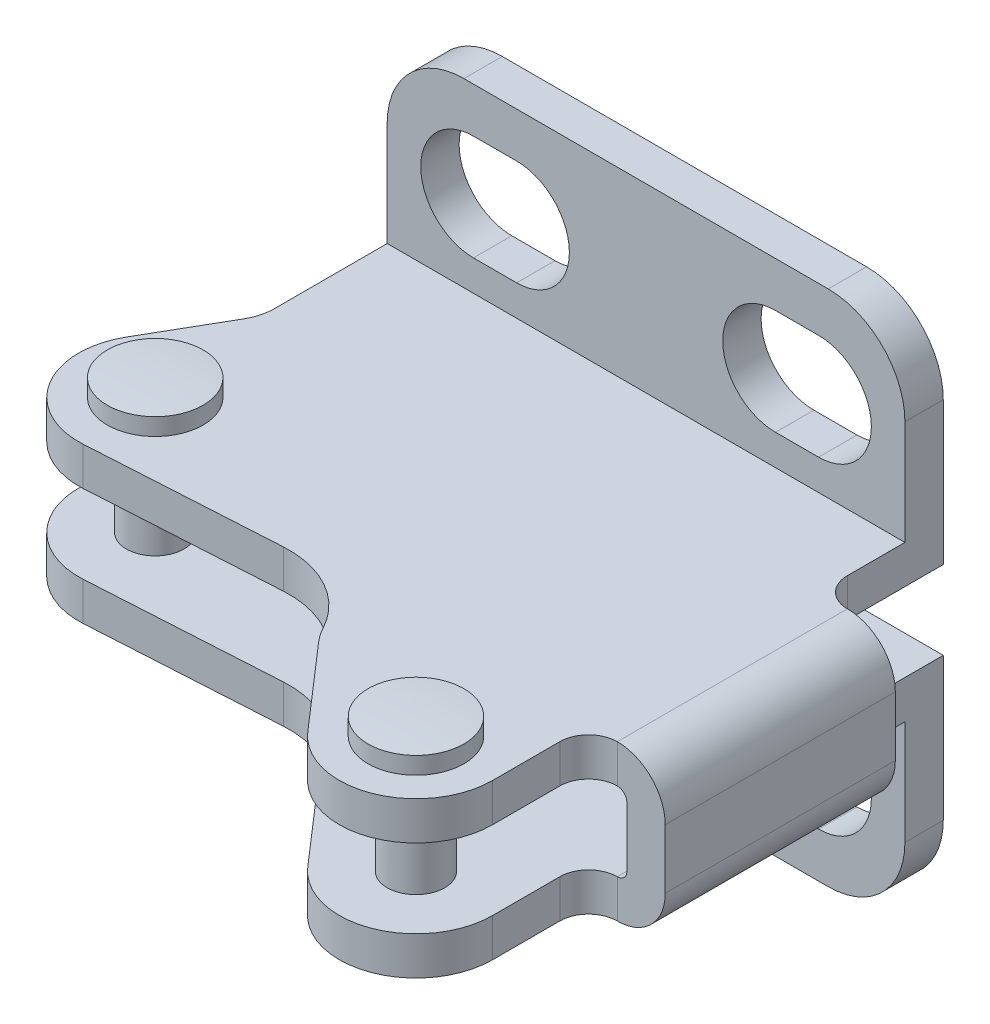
ISO-10303-21;
HEADER;
FILE_DESCRIPTION(('STEP AP214'),'2;1');
FILE_NAME('part.step','',(''),(''),'','','');
FILE_SCHEMA(('AUTOMOTIVE_DESIGN { 1 0 10303 214 1 1 1 1 }'));
ENDSEC;
DATA;
#1=APPLICATION_CONTEXT('core data for automotive mechanical design processes');
#2=APPLICATION_PROTOCOL_DEFINITION('international standard','automotive_design',2000,#1);
#3=PRODUCT_CONTEXT('',#1,'mechanical');
#4=PRODUCT('Part','Part','',(#3));
#5=PRODUCT_RELATED_PRODUCT_CATEGORY('part','',(#4));
#6=PRODUCT_DEFINITION_FORMATION('','',#4);
#7=PRODUCT_DEFINITION_CONTEXT('part definition',#1,'design');
#8=PRODUCT_DEFINITION('design','',#6,#7);
#9=PRODUCT_DEFINITION_SHAPE('','',#8);
#10=(LENGTH_UNIT() NAMED_UNIT(*) SI_UNIT(.MILLI.,.METRE.));
#11=(NAMED_UNIT(*) PLANE_ANGLE_UNIT() SI_UNIT($,.RADIAN.));
#12=(NAMED_UNIT(*) SI_UNIT($,.STERADIAN.) SOLID_ANGLE_UNIT());
#13=UNCERTAINTY_MEASURE_WITH_UNIT(LENGTH_MEASURE(1.E-05),#10,'distance_accuracy_value','');
#14=(GEOMETRIC_REPRESENTATION_CONTEXT(3) GLOBAL_UNCERTAINTY_ASSIGNED_CONTEXT((#13)) GLOBAL_UNIT_ASSIGNED_CONTEXT((#10,
#11,#12)) REPRESENTATION_CONTEXT('',''));
#15=CARTESIAN_POINT('',(0.,0.,0.));
#16=DIRECTION('',(0.,0.,1.));
#17=DIRECTION('',(1.,0.,0.));
#18=AXIS2_PLACEMENT_3D('',#15,#16,#17);
#19=CARTESIAN_POINT('',(-3.6,5.3407477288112,15.));
#20=DIRECTION('',(0.,1.,0.));
#21=DIRECTION('',(1.,0.,0.));
#22=AXIS2_PLACEMENT_3D('',#19,#20,#21);
#23=CYLINDRICAL_SURFACE('',#22,1.5);
#24=CARTESIAN_POINT('',(-3.6,6.35,15.));
#25=DIRECTION('',(0.,1.,0.));
#26=DIRECTION('',(0.,0.,-1.));
#27=AXIS2_PLACEMENT_3D('',#24,#25,#26);
#28=CIRCLE('',#27,1.5);
#29=CARTESIAN_POINT('',(-3.6,6.35,13.5));
#30=VERTEX_POINT('',#29);
#31=EDGE_CURVE('E9',#30,#30,#28,.F.);
#32=ORIENTED_EDGE('',*,*,#31,.F.);
#33=EDGE_LOOP('',(#32));
#34=FACE_BOUND('',#33,.T.);
#35=CARTESIAN_POINT('',(-3.6,10.45,15.));
#36=DIRECTION('',(0.,-1.,0.));
#37=DIRECTION('',(0.,0.,1.));
#38=AXIS2_PLACEMENT_3D('',#35,#36,#37);
#39=CIRCLE('',#38,1.5);
#40=CARTESIAN_POINT('',(-3.6,10.45,16.5));
#41=VERTEX_POINT('',#40);
#42=EDGE_CURVE('E24',#41,#41,#39,.F.);
#43=ORIENTED_EDGE('',*,*,#42,.F.);
#44=EDGE_LOOP('',(#43));
#45=FACE_BOUND('',#44,.T.);
#46=ADVANCED_FACE('F14',(#34,#45),#23,.T.);
#47=CARTESIAN_POINT('',(-3.6,4.85,15.));
#48=DIRECTION('',(0.,-1.,0.));
#49=DIRECTION('',(-1.,0.,0.));
#50=AXIS2_PLACEMENT_3D('',#47,#48,#49);
#51=CONICAL_SURFACE('',#50,0.85,1.04719755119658);
#52=CARTESIAN_POINT('',(-3.6,5.3407477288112,15.));
#53=VERTEX_POINT('',#52);
#54=VERTEX_LOOP('',#53);
#55=FACE_BOUND('',#54,.T.);
#56=CARTESIAN_POINT('',(-3.6,4.85,15.));
#57=DIRECTION('',(0.,1.,0.));
#58=DIRECTION('',(1.,0.,0.));
#59=AXIS2_PLACEMENT_3D('',#56,#57,#58);
#60=CIRCLE('',#59,0.85);
#61=CARTESIAN_POINT('',(-2.75,4.85,15.));
#62=VERTEX_POINT('',#61);
#63=EDGE_CURVE('E876',#62,#62,#60,.T.);
#64=ORIENTED_EDGE('',*,*,#63,.F.);
#65=EDGE_LOOP('',(#64));
#66=FACE_BOUND('',#65,.T.);
#67=ADVANCED_FACE('F1034',(#55,#66),#51,.F.);
#68=CARTESIAN_POINT('',(-3.6,5.3407477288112,15.));
#69=DIRECTION('',(0.,1.,0.));
#70=DIRECTION('',(1.,0.,0.));
#71=AXIS2_PLACEMENT_3D('',#68,#69,#70);
#72=CYLINDRICAL_SURFACE('',#71,0.85000000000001);
#73=ORIENTED_EDGE('',*,*,#63,.T.);
#74=EDGE_LOOP('',(#73));
#75=FACE_BOUND('',#74,.T.);
#76=CARTESIAN_POINT('',(-3.6,3.3620440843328,15.));
#77=DIRECTION('',(0.,1.,0.));
#78=DIRECTION('',(1.,0.,0.));
#79=AXIS2_PLACEMENT_3D('',#76,#77,#78);
#80=CIRCLE('',#79,0.85000000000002);
#81=CARTESIAN_POINT('',(-3.6,3.3620440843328,14.1499999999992));
#82=VERTEX_POINT('',#81);
#83=EDGE_CURVE('E880',#82,#82,#80,.T.);
#84=ORIENTED_EDGE('',*,*,#83,.F.);
#85=EDGE_LOOP('',(#84));
#86=FACE_BOUND('',#85,.T.);
#87=ADVANCED_FACE('F1042',(#75,#86),#72,.F.);
#88=CARTESIAN_POINT('',(-3.6,33.3499999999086,14.9999999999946));
#89=DIRECTION('',(0.,1.,0.));
#90=DIRECTION('',(0.,0.,-1.));
#91=AXIS2_PLACEMENT_3D('',#88,#89,#90);
#92=SPHERICAL_SURFACE('',#91,29.9999999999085);
#93=CARTESIAN_POINT('',(-3.6,3.4543481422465,15.));
#94=DIRECTION('',(0.,1.,0.));
#95=DIRECTION('',(1.,0.,0.));
#96=AXIS2_PLACEMENT_3D('',#93,#94,#95);
#97=CIRCLE('',#96,2.5);
#98=CARTESIAN_POINT('',(-3.6,3.4543481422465,12.4999999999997));
#99=VERTEX_POINT('',#98);
#100=EDGE_CURVE('E2572',#99,#99,#97,.T.);
#101=CARTESIAN_POINT('',(-3.6,3.3620440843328,14.1499999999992));
#102=CARTESIAN_POINT('',(-3.6,3.36253188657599,14.1327903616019));
#103=CARTESIAN_POINT('',(-3.6,3.36303450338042,14.1155811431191));
#104=CARTESIAN_POINT('',(-3.6,3.3640693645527,14.0811635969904));
#105=CARTESIAN_POINT('',(-3.6,3.36460160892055,14.0639552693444));
#106=CARTESIAN_POINT('',(-3.6,3.3656957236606,14.0295395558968));
#107=CARTESIAN_POINT('',(-3.6,3.3662575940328,14.0123321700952));
#108=CARTESIAN_POINT('',(-3.6,3.36741095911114,13.9779183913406));
#109=CARTESIAN_POINT('',(-3.6,3.36800245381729,13.9607119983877));
#110=CARTESIAN_POINT('',(-3.6,3.3692150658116,13.9263002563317));
#111=CARTESIAN_POINT('',(-3.6,3.36983618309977,13.9090949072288));
#112=CARTESIAN_POINT('',(-3.6,3.37110803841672,13.8746853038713));
#113=CARTESIAN_POINT('',(-3.6,3.37175877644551,13.8574810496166));
#114=CARTESIAN_POINT('',(-3.6,3.37308987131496,13.8230736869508));
#115=CARTESIAN_POINT('',(-3.6,3.37377022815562,13.8058705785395));
#116=CARTESIAN_POINT('',(-3.6,3.37516055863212,13.7714655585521));
#117=CARTESIAN_POINT('',(-3.6,3.37587053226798,13.7542636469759));
#118=CARTESIAN_POINT('',(-3.6,3.37732009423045,13.7198610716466));
#119=CARTESIAN_POINT('',(-3.6,3.37805968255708,13.7026604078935));
#120=CARTESIAN_POINT('',(-3.6,3.3795684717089,13.6682603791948));
#121=CARTESIAN_POINT('',(-3.6,3.38033767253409,13.6510610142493));
#122=CARTESIAN_POINT('',(-3.6,3.38190568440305,13.6166636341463));
#123=CARTESIAN_POINT('',(-3.6,3.38270449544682,13.5994656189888));
#124=CARTESIAN_POINT('',(-3.6,3.38433172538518,13.5650709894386));
#125=CARTESIAN_POINT('',(-3.6,3.38516014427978,13.5478743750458));
#126=CARTESIAN_POINT('',(-3.6,3.38684658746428,13.5134825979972));
#127=CARTESIAN_POINT('',(-3.6,3.38770461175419,13.4962874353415));
#128=CARTESIAN_POINT('',(-3.6,3.38945026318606,13.4618986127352));
#129=CARTESIAN_POINT('',(-3.6,3.39033789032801,13.4447049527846));
#130=CARTESIAN_POINT('',(-3.6,3.39214274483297,13.4103191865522));
#131=CARTESIAN_POINT('',(-3.6,3.39305997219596,13.3931270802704));
#132=CARTESIAN_POINT('',(-3.6,3.39492402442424,13.3587444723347));
#133=CARTESIAN_POINT('',(-3.6,3.39587084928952,13.3415539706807));
#134=CARTESIAN_POINT('',(-3.6,3.39779409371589,13.307174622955));
#135=CARTESIAN_POINT('',(-3.6,3.39877051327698,13.2899857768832));
#136=CARTESIAN_POINT('',(-3.6,3.40075294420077,13.2556097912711));
#137=CARTESIAN_POINT('',(-3.6,3.40175895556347,13.2384226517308));
#138=CARTESIAN_POINT('',(-3.6,3.40380056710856,13.204050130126));
#139=CARTESIAN_POINT('',(-3.6,3.40483616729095,13.1868647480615));
#140=CARTESIAN_POINT('',(-3.6,3.40693695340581,13.1524957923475));
#141=CARTESIAN_POINT('',(-3.6,3.40800213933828,13.135312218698));
#142=CARTESIAN_POINT('',(-3.6,3.41016209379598,13.1009469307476));
#143=CARTESIAN_POINT('',(-3.6,3.41125686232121,13.0837652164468));
#144=CARTESIAN_POINT('',(-3.6,3.41347597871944,13.049403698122));
#145=CARTESIAN_POINT('',(-3.6,3.41460032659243,13.0322238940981));
#146=CARTESIAN_POINT('',(-3.6,3.41687859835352,12.9978662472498));
#147=CARTESIAN_POINT('',(-3.6,3.41803252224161,12.9806884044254));
#148=CARTESIAN_POINT('',(-3.6,3.42036994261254,12.9463347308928));
#149=CARTESIAN_POINT('',(-3.6,3.42155343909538,12.9291589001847));
#150=CARTESIAN_POINT('',(-3.6,3.42395000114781,12.8948093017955));
#151=CARTESIAN_POINT('',(-3.6,3.42516306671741,12.8776355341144));
#152=CARTESIAN_POINT('',(-3.6,3.42761876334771,12.843290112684));
#153=CARTESIAN_POINT('',(-3.6,3.42886139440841,12.8261184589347));
#154=CARTESIAN_POINT('',(-3.6,3.43137621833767,12.7917773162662));
#155=CARTESIAN_POINT('',(-3.6,3.43264841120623,12.7746078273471));
#156=CARTESIAN_POINT('',(-3.6,3.4352223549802,12.7402710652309));
#157=CARTESIAN_POINT('',(-3.6,3.43652410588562,12.723103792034));
#158=CARTESIAN_POINT('',(-3.6,3.43915716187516,12.6887715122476));
#159=CARTESIAN_POINT('',(-3.6,3.44048846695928,12.6716065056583));
#160=CARTESIAN_POINT('',(-3.6,3.44318062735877,12.6372788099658));
#161=CARTESIAN_POINT('',(-3.6,3.44454148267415,12.6201161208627));
#162=CARTESIAN_POINT('',(-3.6,3.44729273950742,12.5857931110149));
#163=CARTESIAN_POINT('',(-3.6,3.4486831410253,12.5686327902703));
#164=CARTESIAN_POINT('',(-3.6,3.45149348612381,12.5343145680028));
#165=CARTESIAN_POINT('',(-3.6,3.45291342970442,12.51715666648));
#166=CARTESIAN_POINT('',(-3.6,3.4543481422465,12.4999999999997));
#167=B_SPLINE_CURVE_WITH_KNOTS('',3,(#101,#102,#103,#104,#105,#106,#107,#108,#109,#110,#111,
#112,#113,#114,#115,#116,#117,#118,#119,#120,#121,#122,#123,#124,#125,#126,#127,#128,#129,#130,
#131,#132,#133,#134,#135,#136,#137,#138,#139,#140,#141,#142,#143,#144,#145,#146,#147,#148,#149,
#150,#151,#152,#153,#154,#155,#156,#157,#158,#159,#160,#161,#162,#163,#164,#165,#166),
.UNSPECIFIED.,.F.,.F.,(4,2,2,2,2,2,2,2,2,2,2,2,2,2,2,2,2,2,2,2,2,2,2,2,2,2,2,2,2,2,2,2,4),(0.,
0.0516496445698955,0.103299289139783,0.154948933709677,0.206598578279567,0.258248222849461,
0.309897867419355,0.361547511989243,0.413197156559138,0.464846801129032,0.51649644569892,
0.568146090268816,0.619795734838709,0.671445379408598,0.723095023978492,0.77474466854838,
0.826394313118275,0.878043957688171,0.929693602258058,0.981343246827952,1.03299289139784,
1.08464253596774,1.13629218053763,1.18794182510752,1.23959146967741,1.29124111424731,
1.34289075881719,1.39454040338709,1.44619004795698,1.49783969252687,1.54948933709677,
1.60113898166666,1.65278862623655),.UNSPECIFIED.);
#168=EDGE_CURVE('BSEAM1038',#82,#99,#167,.T.);
#169=ORIENTED_EDGE('',*,*,#83,.T.);
#170=ORIENTED_EDGE('',*,*,#100,.F.);
#171=ORIENTED_EDGE('',*,*,#168,.T.);
#172=ORIENTED_EDGE('',*,*,#168,.F.);
#173=EDGE_LOOP('',(#169,#171,#170,#172));
#174=FACE_BOUND('',#173,.T.);
#175=ADVANCED_FACE('F1038',(#174),#92,.T.);
#176=CARTESIAN_POINT('',(-3.6,5.3407477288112,15.));
#177=DIRECTION('',(0.,1.,0.));
#178=DIRECTION('',(1.,0.,0.));
#179=AXIS2_PLACEMENT_3D('',#176,#177,#178);
#180=CYLINDRICAL_SURFACE('',#179,2.5);
#181=ORIENTED_EDGE('',*,*,#100,.T.);
#182=EDGE_LOOP('',(#181));
#183=FACE_BOUND('',#182,.T.);
#184=CARTESIAN_POINT('',(-3.6,4.35,15.));
#185=DIRECTION('',(0.,1.,0.));
#186=DIRECTION('',(1.,0.,0.));
#187=AXIS2_PLACEMENT_3D('',#184,#185,#186);
#188=CIRCLE('',#187,2.5);
#189=CARTESIAN_POINT('',(-1.1,4.35,15.));
#190=VERTEX_POINT('',#189);
#191=EDGE_CURVE('E2569',#190,#190,#188,.T.);
#192=ORIENTED_EDGE('',*,*,#191,.F.);
#193=EDGE_LOOP('',(#192));
#194=FACE_BOUND('',#193,.T.);
#195=ADVANCED_FACE('F1027',(#183,#194),#180,.T.);
#196=CARTESIAN_POINT('',(-3.6,-16.5499999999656,14.9999999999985));
#197=DIRECTION('',(0.,1.,0.));
#198=DIRECTION('',(0.,0.,1.));
#199=AXIS2_PLACEMENT_3D('',#196,#197,#198);
#200=SPHERICAL_SURFACE('',#199,29.9999999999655);
#201=CARTESIAN_POINT('',(-3.6,13.3456518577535,15.));
#202=DIRECTION('',(0.,1.,0.));
#203=DIRECTION('',(1.,0.,0.));
#204=AXIS2_PLACEMENT_3D('',#201,#202,#203);
#205=CIRCLE('',#204,2.5);
#206=CARTESIAN_POINT('',(-1.1,13.3456518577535,15.));
#207=VERTEX_POINT('',#206);
#208=EDGE_CURVE('E2547',#207,#207,#205,.T.);
#209=ORIENTED_EDGE('',*,*,#208,.T.);
#210=EDGE_LOOP('',(#209));
#211=FACE_BOUND('',#210,.T.);
#212=ADVANCED_FACE('F1024',(#211),#200,.T.);
#213=CARTESIAN_POINT('',(-3.6,5.3407477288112,15.));
#214=DIRECTION('',(0.,1.,0.));
#215=DIRECTION('',(1.,0.,0.));
#216=AXIS2_PLACEMENT_3D('',#213,#214,#215);
#217=CYLINDRICAL_SURFACE('',#216,2.5);
#218=CARTESIAN_POINT('',(-3.6,12.45,15.));
#219=DIRECTION('',(0.,1.,0.));
#220=DIRECTION('',(1.,0.,0.));
#221=AXIS2_PLACEMENT_3D('',#218,#219,#220);
#222=CIRCLE('',#221,2.5);
#223=CARTESIAN_POINT('',(-1.1,12.45,15.));
#224=VERTEX_POINT('',#223);
#225=EDGE_CURVE('E2550',#224,#224,#222,.T.);
#226=ORIENTED_EDGE('',*,*,#225,.T.);
#227=EDGE_LOOP('',(#226));
#228=FACE_BOUND('',#227,.T.);
#229=ORIENTED_EDGE('',*,*,#208,.F.);
#230=EDGE_LOOP('',(#229));
#231=FACE_BOUND('',#230,.T.);
#232=ADVANCED_FACE('F1022',(#228,#231),#217,.T.);
#233=CARTESIAN_POINT('',(18.5,4.85,23.5));
#234=DIRECTION('',(0.,-1.,0.));
#235=DIRECTION('',(-1.,0.,0.));
#236=AXIS2_PLACEMENT_3D('',#233,#234,#235);
#237=CONICAL_SURFACE('',#236,0.85,1.04719755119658);
#238=CARTESIAN_POINT('',(18.5,5.3407477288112,23.5));
#239=VERTEX_POINT('',#238);
#240=VERTEX_LOOP('',#239);
#241=FACE_BOUND('',#240,.T.);
#242=CARTESIAN_POINT('',(18.5,4.85,23.5));
#243=DIRECTION('',(0.,1.,0.));
#244=DIRECTION('',(1.,0.,0.));
#245=AXIS2_PLACEMENT_3D('',#242,#243,#244);
#246=CIRCLE('',#245,0.85);
#247=CARTESIAN_POINT('',(19.35,4.85,23.5));
#248=VERTEX_POINT('',#247);
#249=EDGE_CURVE('E873',#248,#248,#246,.T.);
#250=ORIENTED_EDGE('',*,*,#249,.F.);
#251=EDGE_LOOP('',(#250));
#252=FACE_BOUND('',#251,.T.);
#253=ADVANCED_FACE('F957',(#241,#252),#237,.F.);
#254=CARTESIAN_POINT('',(18.5,5.3407477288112,23.5));
#255=DIRECTION('',(0.,1.,0.));
#256=DIRECTION('',(1.,0.,0.));
#257=AXIS2_PLACEMENT_3D('',#254,#255,#256);
#258=CYLINDRICAL_SURFACE('',#257,0.85000000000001);
#259=ORIENTED_EDGE('',*,*,#249,.T.);
#260=EDGE_LOOP('',(#259));
#261=FACE_BOUND('',#260,.T.);
#262=CARTESIAN_POINT('',(18.5,3.3620440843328,23.5));
#263=DIRECTION('',(0.,1.,0.));
#264=DIRECTION('',(1.,0.,0.));
#265=AXIS2_PLACEMENT_3D('',#262,#263,#264);
#266=CIRCLE('',#265,0.85000000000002);
#267=CARTESIAN_POINT('',(18.5,3.3620440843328,22.6499999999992));
#268=VERTEX_POINT('',#267);
#269=EDGE_CURVE('E2556',#268,#268,#266,.T.);
#270=ORIENTED_EDGE('',*,*,#269,.F.);
#271=EDGE_LOOP('',(#270));
#272=FACE_BOUND('',#271,.T.);
#273=ADVANCED_FACE('F965',(#261,#272),#258,.F.);
#274=CARTESIAN_POINT('',(18.5,-16.5499999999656,23.4999999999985));
#275=DIRECTION('',(0.,1.,0.));
#276=DIRECTION('',(0.,0.,1.));
#277=AXIS2_PLACEMENT_3D('',#274,#275,#276);
#278=SPHERICAL_SURFACE('',#277,29.9999999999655);
#279=CARTESIAN_POINT('',(18.5,13.3456518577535,23.5));
#280=DIRECTION('',(0.,1.,0.));
#281=DIRECTION('',(1.,0.,0.));
#282=AXIS2_PLACEMENT_3D('',#279,#280,#281);
#283=CIRCLE('',#282,2.5);
#284=CARTESIAN_POINT('',(21.,13.3456518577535,23.5));
#285=VERTEX_POINT('',#284);
#286=EDGE_CURVE('E883',#285,#285,#283,.T.);
#287=ORIENTED_EDGE('',*,*,#286,.T.);
#288=EDGE_LOOP('',(#287));
#289=FACE_BOUND('',#288,.T.);
#290=ADVANCED_FACE('F949',(#289),#278,.T.);
#291=CARTESIAN_POINT('',(18.,19.55,2.));
#292=DIRECTION('',(0.,-1.,0.));
#293=DIRECTION('',(1.,0.,0.));
#294=AXIS2_PLACEMENT_3D('',#291,#292,#293);
#295=PLANE('',#294);
#296=DIRECTION('',(-1.,0.,0.));
#297=VECTOR('',#296,1.);
#298=CARTESIAN_POINT('',(18.,19.55,0.));
#299=LINE('',#298,#297);
#300=CARTESIAN_POINT('',(18.,19.55,0.));
#301=VERTEX_POINT('',#300);
#302=CARTESIAN_POINT('',(15.75,19.55,0.));
#303=VERTEX_POINT('',#302);
#304=EDGE_CURVE('E406',#301,#303,#299,.T.);
#305=ORIENTED_EDGE('',*,*,#304,.F.);
#306=DIRECTION('',(0.,0.,-1.));
#307=VECTOR('',#306,1.);
#308=CARTESIAN_POINT('',(18.,19.55,2.));
#309=LINE('',#308,#307);
#310=CARTESIAN_POINT('',(18.,19.55,2.));
#311=VERTEX_POINT('',#310);
#312=EDGE_CURVE('E424',#311,#301,#309,.T.);
#313=ORIENTED_EDGE('',*,*,#312,.F.);
#314=DIRECTION('',(-1.,0.,0.));
#315=VECTOR('',#314,1.);
#316=CARTESIAN_POINT('',(18.,19.55,2.));
#317=LINE('',#316,#315);
#318=CARTESIAN_POINT('',(15.75,19.55,2.));
#319=VERTEX_POINT('',#318);
#320=EDGE_CURVE('E420',#311,#319,#317,.T.);
#321=ORIENTED_EDGE('',*,*,#320,.T.);
#322=DIRECTION('',(0.,0.,-1.));
#323=VECTOR('',#322,1.);
#324=CARTESIAN_POINT('',(15.75,19.55,2.));
#325=LINE('',#324,#323);
#326=EDGE_CURVE('E378',#319,#303,#325,.T.);
#327=ORIENTED_EDGE('',*,*,#326,.T.);
#328=EDGE_LOOP('',(#305,#313,#321,#327));
#329=FACE_BOUND('',#328,.T.);
#330=ADVANCED_FACE('F903',(#329),#295,.T.);
#331=CARTESIAN_POINT('',(18.,16.8,2.));
#332=DIRECTION('',(0.,0.,-1.));
#333=DIRECTION('',(0.,-1.,0.));
#334=AXIS2_PLACEMENT_3D('',#331,#332,#333);
#335=CYLINDRICAL_SURFACE('',#334,2.75);
#336=CARTESIAN_POINT('',(18.,16.8,0.));
#337=DIRECTION('',(0.,0.,1.));
#338=DIRECTION('',(-1.,0.,0.));
#339=AXIS2_PLACEMENT_3D('',#336,#337,#338);
#340=CIRCLE('',#339,2.75);
#341=CARTESIAN_POINT('',(18.,14.05,0.));
#342=VERTEX_POINT('',#341);
#343=EDGE_CURVE('E396',#342,#301,#340,.T.);
#344=ORIENTED_EDGE('',*,*,#343,.F.);
#345=DIRECTION('',(0.,0.,-1.));
#346=VECTOR('',#345,1.);
#347=CARTESIAN_POINT('',(18.,14.05,2.));
#348=LINE('',#347,#346);
#349=CARTESIAN_POINT('',(18.,14.05,2.));
#350=VERTEX_POINT('',#349);
#351=EDGE_CURVE('E391',#350,#342,#348,.T.);
#352=ORIENTED_EDGE('',*,*,#351,.F.);
#353=CARTESIAN_POINT('',(18.,16.8,2.));
#354=DIRECTION('',(0.,0.,1.));
#355=DIRECTION('',(-1.,0.,0.));
#356=AXIS2_PLACEMENT_3D('',#353,#354,#355);
#357=CIRCLE('',#356,2.75);
#358=EDGE_CURVE('E414',#350,#311,#357,.T.);
#359=ORIENTED_EDGE('',*,*,#358,.T.);
#360=ORIENTED_EDGE('',*,*,#312,.T.);
#361=EDGE_LOOP('',(#344,#352,#359,#360));
#362=FACE_BOUND('',#361,.T.);
#363=ADVANCED_FACE('F898',(#362),#335,.F.);
#364=CARTESIAN_POINT('',(15.75,14.05,2.));
#365=DIRECTION('',(0.,1.,0.));
#366=DIRECTION('',(-1.,0.,0.));
#367=AXIS2_PLACEMENT_3D('',#364,#365,#366);
#368=PLANE('',#367);
#369=DIRECTION('',(1.,0.,0.));
#370=VECTOR('',#369,1.);
#371=CARTESIAN_POINT('',(15.75,14.05,0.));
#372=LINE('',#371,#370);
#373=CARTESIAN_POINT('',(15.75,14.05,0.));
#374=VERTEX_POINT('',#373);
#375=EDGE_CURVE('E385',#374,#342,#372,.T.);
#376=ORIENTED_EDGE('',*,*,#375,.F.);
#377=DIRECTION('',(0.,0.,-1.));
#378=VECTOR('',#377,1.);
#379=CARTESIAN_POINT('',(15.75,14.05,2.));
#380=LINE('',#379,#378);
#381=CARTESIAN_POINT('',(15.75,14.05,2.));
#382=VERTEX_POINT('',#381);
#383=EDGE_CURVE('E388',#382,#374,#380,.T.);
#384=ORIENTED_EDGE('',*,*,#383,.F.);
#385=DIRECTION('',(1.,0.,0.));
#386=VECTOR('',#385,1.);
#387=CARTESIAN_POINT('',(15.75,14.05,2.));
#388=LINE('',#387,#386);
#389=EDGE_CURVE('E408',#382,#350,#388,.T.);
#390=ORIENTED_EDGE('',*,*,#389,.T.);
#391=ORIENTED_EDGE('',*,*,#351,.T.);
#392=EDGE_LOOP('',(#376,#384,#390,#391));
#393=FACE_BOUND('',#392,.T.);
#394=ADVANCED_FACE('F387',(#393),#368,.T.);
#395=CARTESIAN_POINT('',(15.75,16.8,2.));
#396=DIRECTION('',(0.,0.,-1.));
#397=DIRECTION('',(0.,-1.,0.));
#398=AXIS2_PLACEMENT_3D('',#395,#396,#397);
#399=CYLINDRICAL_SURFACE('',#398,2.75);
#400=CARTESIAN_POINT('',(15.75,16.8,0.));
#401=DIRECTION('',(0.,0.,1.));
#402=DIRECTION('',(1.,0.,0.));
#403=AXIS2_PLACEMENT_3D('',#400,#401,#402);
#404=CIRCLE('',#403,2.75);
#405=EDGE_CURVE('E399',#303,#374,#404,.T.);
#406=ORIENTED_EDGE('',*,*,#405,.F.);
#407=ORIENTED_EDGE('',*,*,#326,.F.);
#408=CARTESIAN_POINT('',(15.75,16.8,2.));
#409=DIRECTION('',(0.,0.,1.));
#410=DIRECTION('',(1.,0.,0.));
#411=AXIS2_PLACEMENT_3D('',#408,#409,#410);
#412=CIRCLE('',#411,2.75);
#413=EDGE_CURVE('E402',#319,#382,#412,.T.);
#414=ORIENTED_EDGE('',*,*,#413,.T.);
#415=ORIENTED_EDGE('',*,*,#383,.T.);
#416=EDGE_LOOP('',(#406,#407,#414,#415));
#417=FACE_BOUND('',#416,.T.);
#418=ADVANCED_FACE('F398',(#417),#399,.F.);
#419=CARTESIAN_POINT('',(18.4999999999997,17.8999999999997,2.));
#420=DIRECTION('',(0.,0.,-1.));
#421=DIRECTION('',(0.,-1.,0.));
#422=AXIS2_PLACEMENT_3D('',#419,#420,#421);
#423=CYLINDRICAL_SURFACE('',#422,4.00000000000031);
#424=CARTESIAN_POINT('',(18.4999999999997,17.8999999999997,0.));
#425=DIRECTION('',(0.,0.,1.));
#426=DIRECTION('',(-1.,0.,0.));
#427=AXIS2_PLACEMENT_3D('',#424,#425,#426);
#428=CIRCLE('',#427,4.00000000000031);
#429=CARTESIAN_POINT('',(22.5,17.9,0.));
#430=VERTEX_POINT('',#429);
#431=CARTESIAN_POINT('',(18.5,21.9,0.));
#432=VERTEX_POINT('',#431);
#433=EDGE_CURVE('E652',#430,#432,#428,.T.);
#434=ORIENTED_EDGE('',*,*,#433,.T.);
#435=DIRECTION('',(0.,0.,-1.));
#436=VECTOR('',#435,1.);
#437=CARTESIAN_POINT('',(18.5,21.9,2.));
#438=LINE('',#437,#436);
#439=CARTESIAN_POINT('',(18.5,21.9,2.));
#440=VERTEX_POINT('',#439);
#441=EDGE_CURVE('E709',#440,#432,#438,.T.);
#442=ORIENTED_EDGE('',*,*,#441,.F.);
#443=CARTESIAN_POINT('',(18.4999999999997,17.8999999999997,2.));
#444=DIRECTION('',(0.,0.,1.));
#445=DIRECTION('',(-1.,0.,0.));
#446=AXIS2_PLACEMENT_3D('',#443,#444,#445);
#447=CIRCLE('',#446,4.00000000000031);
#448=CARTESIAN_POINT('',(22.5,17.9,2.));
#449=VERTEX_POINT('',#448);
#450=EDGE_CURVE('E673',#449,#440,#447,.T.);
#451=ORIENTED_EDGE('',*,*,#450,.F.);
#452=DIRECTION('',(0.,0.,-1.));
#453=VECTOR('',#452,1.);
#454=CARTESIAN_POINT('',(22.5,17.9,2.));
#455=LINE('',#454,#453);
#456=EDGE_CURVE('E712',#449,#430,#455,.T.);
#457=ORIENTED_EDGE('',*,*,#456,.T.);
#458=EDGE_LOOP('',(#434,#442,#451,#457));
#459=FACE_BOUND('',#458,.T.);
#460=ADVANCED_FACE('F1001',(#459),#423,.T.);
#461=CARTESIAN_POINT('',(18.5,21.9,2.));
#462=DIRECTION('',(0.,-1.,0.));
#463=DIRECTION('',(1.,0.,0.));
#464=AXIS2_PLACEMENT_3D('',#461,#462,#463);
#465=PLANE('',#464);
#466=DIRECTION('',(-1.,0.,0.));
#467=VECTOR('',#466,1.);
#468=CARTESIAN_POINT('',(18.5,21.9,0.));
#469=LINE('',#468,#467);
#470=CARTESIAN_POINT('',(-0.5,21.9,0.));
#471=VERTEX_POINT('',#470);
#472=EDGE_CURVE('E655',#432,#471,#469,.T.);
#473=ORIENTED_EDGE('',*,*,#472,.T.);
#474=DIRECTION('',(0.,0.,-1.));
#475=VECTOR('',#474,1.);
#476=CARTESIAN_POINT('',(-0.5,21.9,2.));
#477=LINE('',#476,#475);
#478=CARTESIAN_POINT('',(-0.5,21.9,2.));
#479=VERTEX_POINT('',#478);
#480=EDGE_CURVE('E706',#479,#471,#477,.T.);
#481=ORIENTED_EDGE('',*,*,#480,.F.);
#482=DIRECTION('',(-1.,0.,0.));
#483=VECTOR('',#482,1.);
#484=CARTESIAN_POINT('',(18.5,21.9,2.));
#485=LINE('',#484,#483);
#486=EDGE_CURVE('E675',#440,#479,#485,.T.);
#487=ORIENTED_EDGE('',*,*,#486,.F.);
#488=ORIENTED_EDGE('',*,*,#441,.T.);
#489=EDGE_LOOP('',(#473,#481,#487,#488));
#490=FACE_BOUND('',#489,.T.);
#491=ADVANCED_FACE('F1058',(#490),#465,.F.);
#492=CARTESIAN_POINT('',(2.25,19.55,2.));
#493=DIRECTION('',(0.,-1.,0.));
#494=DIRECTION('',(1.,0.,0.));
#495=AXIS2_PLACEMENT_3D('',#492,#493,#494);
#496=PLANE('',#495);
#497=DIRECTION('',(-1.,0.,0.));
#498=VECTOR('',#497,1.);
#499=CARTESIAN_POINT('',(2.25,19.55,0.));
#500=LINE('',#499,#498);
#501=CARTESIAN_POINT('',(2.25,19.55,0.));
#502=VERTEX_POINT('',#501);
#503=CARTESIAN_POINT('',(0.,19.55,0.));
#504=VERTEX_POINT('',#503);
#505=EDGE_CURVE('E432',#502,#504,#500,.T.);
#506=ORIENTED_EDGE('',*,*,#505,.F.);
#507=DIRECTION('',(0.,0.,-1.));
#508=VECTOR('',#507,1.);
#509=CARTESIAN_POINT('',(2.25,19.55,2.));
#510=LINE('',#509,#508);
#511=CARTESIAN_POINT('',(2.25,19.55,2.));
#512=VERTEX_POINT('',#511);
#513=EDGE_CURVE('E456',#512,#502,#510,.T.);
#514=ORIENTED_EDGE('',*,*,#513,.F.);
#515=DIRECTION('',(-1.,0.,0.));
#516=VECTOR('',#515,1.);
#517=CARTESIAN_POINT('',(2.25,19.55,2.));
#518=LINE('',#517,#516);
#519=CARTESIAN_POINT('',(0.,19.55,2.));
#520=VERTEX_POINT('',#519);
#521=EDGE_CURVE('E445',#512,#520,#518,.T.);
#522=ORIENTED_EDGE('',*,*,#521,.T.);
#523=DIRECTION('',(0.,0.,-1.));
#524=VECTOR('',#523,1.);
#525=CARTESIAN_POINT('',(0.,19.55,2.));
#526=LINE('',#525,#524);
#527=EDGE_CURVE('E454',#520,#504,#526,.T.);
#528=ORIENTED_EDGE('',*,*,#527,.T.);
#529=EDGE_LOOP('',(#506,#514,#522,#528));
#530=FACE_BOUND('',#529,.T.);
#531=ADVANCED_FACE('F1071',(#530),#496,.T.);
#532=CARTESIAN_POINT('',(2.25,16.8,2.));
#533=DIRECTION('',(0.,0.,-1.));
#534=DIRECTION('',(0.,-1.,0.));
#535=AXIS2_PLACEMENT_3D('',#532,#533,#534);
#536=CYLINDRICAL_SURFACE('',#535,2.75);
#537=CARTESIAN_POINT('',(2.25,16.8,0.));
#538=DIRECTION('',(0.,0.,1.));
#539=DIRECTION('',(-1.,0.,0.));
#540=AXIS2_PLACEMENT_3D('',#537,#538,#539);
#541=CIRCLE('',#540,2.75);
#542=CARTESIAN_POINT('',(2.25,14.05,0.));
#543=VERTEX_POINT('',#542);
#544=EDGE_CURVE('E428',#543,#502,#541,.T.);
#545=ORIENTED_EDGE('',*,*,#544,.F.);
#546=DIRECTION('',(0.,0.,-1.));
#547=VECTOR('',#546,1.);
#548=CARTESIAN_POINT('',(2.25,14.05,2.));
#549=LINE('',#548,#547);
#550=CARTESIAN_POINT('',(2.25,14.05,2.));
#551=VERTEX_POINT('',#550);
#552=EDGE_CURVE('E458',#551,#543,#549,.T.);
#553=ORIENTED_EDGE('',*,*,#552,.F.);
#554=CARTESIAN_POINT('',(2.25,16.8,2.));
#555=DIRECTION('',(0.,0.,1.));
#556=DIRECTION('',(-1.,0.,0.));
#557=AXIS2_PLACEMENT_3D('',#554,#555,#556);
#558=CIRCLE('',#557,2.75);
#559=EDGE_CURVE('E443',#551,#512,#558,.T.);
#560=ORIENTED_EDGE('',*,*,#559,.T.);
#561=ORIENTED_EDGE('',*,*,#513,.T.);
#562=EDGE_LOOP('',(#545,#553,#560,#561));
#563=FACE_BOUND('',#562,.T.);
#564=ADVANCED_FACE('F1074',(#563),#536,.F.);
#565=CARTESIAN_POINT('',(0.,14.05,2.));
#566=DIRECTION('',(0.,1.,0.));
#567=DIRECTION('',(-1.,0.,0.));
#568=AXIS2_PLACEMENT_3D('',#565,#566,#567);
#569=PLANE('',#568);
#570=DIRECTION('',(1.,0.,0.));
#571=VECTOR('',#570,1.);
#572=CARTESIAN_POINT('',(0.,14.05,0.));
#573=LINE('',#572,#571);
#574=CARTESIAN_POINT('',(0.,14.05,0.));
#575=VERTEX_POINT('',#574);
#576=EDGE_CURVE('E427',#575,#543,#573,.T.);
#577=ORIENTED_EDGE('',*,*,#576,.F.);
#578=DIRECTION('',(0.,0.,-1.));
#579=VECTOR('',#578,1.);
#580=CARTESIAN_POINT('',(0.,14.05,2.));
#581=LINE('',#580,#579);
#582=CARTESIAN_POINT('',(0.,14.05,2.));
#583=VERTEX_POINT('',#582);
#584=EDGE_CURVE('E450',#583,#575,#581,.T.);
#585=ORIENTED_EDGE('',*,*,#584,.F.);
#586=DIRECTION('',(1.,0.,0.));
#587=VECTOR('',#586,1.);
#588=CARTESIAN_POINT('',(0.,14.05,2.));
#589=LINE('',#588,#587);
#590=EDGE_CURVE('E440',#583,#551,#589,.T.);
#591=ORIENTED_EDGE('',*,*,#590,.T.);
#592=ORIENTED_EDGE('',*,*,#552,.T.);
#593=EDGE_LOOP('',(#577,#585,#591,#592));
#594=FACE_BOUND('',#593,.T.);
#595=ADVANCED_FACE('F1069',(#594),#569,.T.);
#596=CARTESIAN_POINT('',(0.,16.8,2.));
#597=DIRECTION('',(0.,0.,-1.));
#598=DIRECTION('',(0.,-1.,0.));
#599=AXIS2_PLACEMENT_3D('',#596,#597,#598);
#600=CYLINDRICAL_SURFACE('',#599,2.75);
#601=CARTESIAN_POINT('',(0.,16.8,0.));
#602=DIRECTION('',(0.,0.,1.));
#603=DIRECTION('',(1.,0.,0.));
#604=AXIS2_PLACEMENT_3D('',#601,#602,#603);
#605=CIRCLE('',#604,2.75);
#606=EDGE_CURVE('E436',#504,#575,#605,.T.);
#607=ORIENTED_EDGE('',*,*,#606,.F.);
#608=ORIENTED_EDGE('',*,*,#527,.F.);
#609=CARTESIAN_POINT('',(0.,16.8,2.));
#610=DIRECTION('',(0.,0.,1.));
#611=DIRECTION('',(1.,0.,0.));
#612=AXIS2_PLACEMENT_3D('',#609,#610,#611);
#613=CIRCLE('',#612,2.75);
#614=EDGE_CURVE('E448',#520,#583,#613,.T.);
#615=ORIENTED_EDGE('',*,*,#614,.T.);
#616=ORIENTED_EDGE('',*,*,#584,.T.);
#617=EDGE_LOOP('',(#607,#608,#615,#616));
#618=FACE_BOUND('',#617,.T.);
#619=ADVANCED_FACE('F1062',(#618),#600,.F.);
#620=CARTESIAN_POINT('',(-0.499999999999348,17.8999999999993,2.));
#621=DIRECTION('',(0.,0.,-1.));
#622=DIRECTION('',(0.,-1.,0.));
#623=AXIS2_PLACEMENT_3D('',#620,#621,#622);
#624=CYLINDRICAL_SURFACE('',#623,4.00000000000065);
#625=CARTESIAN_POINT('',(-0.499999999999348,17.8999999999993,0.));
#626=DIRECTION('',(0.,0.,1.));
#627=DIRECTION('',(1.,0.,0.));
#628=AXIS2_PLACEMENT_3D('',#625,#626,#627);
#629=CIRCLE('',#628,4.00000000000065);
#630=CARTESIAN_POINT('',(-4.5,17.8999999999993,0.));
#631=VERTEX_POINT('',#630);
#632=EDGE_CURVE('E658',#471,#631,#629,.T.);
#633=ORIENTED_EDGE('',*,*,#632,.T.);
#634=DIRECTION('',(0.,0.,-1.));
#635=VECTOR('',#634,1.);
#636=CARTESIAN_POINT('',(-4.5,17.8999999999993,2.));
#637=LINE('',#636,#635);
#638=CARTESIAN_POINT('',(-4.5,17.8999999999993,2.));
#639=VERTEX_POINT('',#638);
#640=EDGE_CURVE('E703',#639,#631,#637,.T.);
#641=ORIENTED_EDGE('',*,*,#640,.F.);
#642=CARTESIAN_POINT('',(-0.499999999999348,17.8999999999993,2.));
#643=DIRECTION('',(0.,0.,1.));
#644=DIRECTION('',(1.,0.,0.));
#645=AXIS2_PLACEMENT_3D('',#642,#643,#644);
#646=CIRCLE('',#645,4.00000000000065);
#647=EDGE_CURVE('E678',#479,#639,#646,.T.);
#648=ORIENTED_EDGE('',*,*,#647,.F.);
#649=ORIENTED_EDGE('',*,*,#480,.T.);
#650=EDGE_LOOP('',(#633,#641,#648,#649));
#651=FACE_BOUND('',#650,.T.);
#652=ADVANCED_FACE('F1068',(#651),#624,.T.);
#653=CARTESIAN_POINT('',(24.5,6.85,27.5));
#654=DIRECTION('',(-1.,0.,0.));
#655=DIRECTION('',(0.,-1.,0.));
#656=AXIS2_PLACEMENT_3D('',#653,#654,#655);
#657=PLANE('',#656);
#658=DIRECTION('',(0.,0.,-1.));
#659=VECTOR('',#658,1.);
#660=CARTESIAN_POINT('',(24.5,6.85,27.5));
#661=LINE('',#660,#659);
#662=CARTESIAN_POINT('',(24.5,6.85,18.5));
#663=VERTEX_POINT('',#662);
#664=CARTESIAN_POINT('',(24.5,6.85,6.5));
#665=VERTEX_POINT('',#664);
#666=EDGE_CURVE('E561',#663,#665,#661,.T.);
#667=ORIENTED_EDGE('',*,*,#666,.F.);
#668=DIRECTION('',(0.,-1.,0.));
#669=VECTOR('',#668,1.);
#670=CARTESIAN_POINT('',(24.5,4.35,18.5));
#671=LINE('',#670,#669);
#672=CARTESIAN_POINT('',(24.5,9.95,18.5));
#673=VERTEX_POINT('',#672);
#674=EDGE_CURVE('E862',#673,#663,#671,.T.);
#675=ORIENTED_EDGE('',*,*,#674,.F.);
#676=DIRECTION('',(0.,0.,-1.));
#677=VECTOR('',#676,1.);
#678=CARTESIAN_POINT('',(24.5,9.95,27.5));
#679=LINE('',#678,#677);
#680=CARTESIAN_POINT('',(24.5,9.95,6.5));
#681=VERTEX_POINT('',#680);
#682=EDGE_CURVE('E570',#673,#681,#679,.T.);
#683=ORIENTED_EDGE('',*,*,#682,.T.);
#684=DIRECTION('',(0.,1.,0.));
#685=VECTOR('',#684,1.);
#686=CARTESIAN_POINT('',(24.5,4.35,6.5));
#687=LINE('',#686,#685);
#688=EDGE_CURVE('E579',#665,#681,#687,.T.);
#689=ORIENTED_EDGE('',*,*,#688,.F.);
#690=EDGE_LOOP('',(#667,#675,#683,#689));
#691=FACE_BOUND('',#690,.T.);
#692=ADVANCED_FACE('F988',(#691),#657,.T.);
#693=CARTESIAN_POINT('',(18.,2.75,2.));
#694=DIRECTION('',(0.,-1.,0.));
#695=DIRECTION('',(1.,0.,0.));
#696=AXIS2_PLACEMENT_3D('',#693,#694,#695);
#697=PLANE('',#696);
#698=DIRECTION('',(-1.,0.,0.));
#699=VECTOR('',#698,1.);
#700=CARTESIAN_POINT('',(18.,2.75,0.));
#701=LINE('',#700,#699);
#702=CARTESIAN_POINT('',(18.,2.75,0.));
#703=VERTEX_POINT('',#702);
#704=CARTESIAN_POINT('',(15.75,2.75,0.));
#705=VERTEX_POINT('',#704);
#706=EDGE_CURVE('E466',#703,#705,#701,.T.);
#707=ORIENTED_EDGE('',*,*,#706,.F.);
#708=DIRECTION('',(0.,0.,-1.));
#709=VECTOR('',#708,1.);
#710=CARTESIAN_POINT('',(18.,2.75,2.));
#711=LINE('',#710,#709);
#712=CARTESIAN_POINT('',(18.,2.75,2.));
#713=VERTEX_POINT('',#712);
#714=EDGE_CURVE('E491',#713,#703,#711,.T.);
#715=ORIENTED_EDGE('',*,*,#714,.F.);
#716=DIRECTION('',(-1.,0.,0.));
#717=VECTOR('',#716,1.);
#718=CARTESIAN_POINT('',(18.,2.75,2.));
#719=LINE('',#718,#717);
#720=CARTESIAN_POINT('',(15.75,2.75,2.));
#721=VERTEX_POINT('',#720);
#722=EDGE_CURVE('E480',#713,#721,#719,.T.);
#723=ORIENTED_EDGE('',*,*,#722,.T.);
#724=DIRECTION('',(0.,0.,-1.));
#725=VECTOR('',#724,1.);
#726=CARTESIAN_POINT('',(15.75,2.75,2.));
#727=LINE('',#726,#725);
#728=EDGE_CURVE('E489',#721,#705,#727,.T.);
#729=ORIENTED_EDGE('',*,*,#728,.T.);
#730=EDGE_LOOP('',(#707,#715,#723,#729));
#731=FACE_BOUND('',#730,.T.);
#732=ADVANCED_FACE('F1086',(#731),#697,.T.);
#733=CARTESIAN_POINT('',(15.75,0.,2.));
#734=DIRECTION('',(0.,0.,-1.));
#735=DIRECTION('',(0.,-1.,0.));
#736=AXIS2_PLACEMENT_3D('',#733,#734,#735);
#737=CYLINDRICAL_SURFACE('',#736,2.75);
#738=CARTESIAN_POINT('',(15.75,0.,0.));
#739=DIRECTION('',(0.,0.,1.));
#740=DIRECTION('',(1.,0.,0.));
#741=AXIS2_PLACEMENT_3D('',#738,#739,#740);
#742=CIRCLE('',#741,2.75);
#743=CARTESIAN_POINT('',(15.75,-2.75,0.));
#744=VERTEX_POINT('',#743);
#745=EDGE_CURVE('E470',#705,#744,#742,.T.);
#746=ORIENTED_EDGE('',*,*,#745,.F.);
#747=ORIENTED_EDGE('',*,*,#728,.F.);
#748=CARTESIAN_POINT('',(15.75,0.,2.));
#749=DIRECTION('',(0.,0.,1.));
#750=DIRECTION('',(1.,0.,0.));
#751=AXIS2_PLACEMENT_3D('',#748,#749,#750);
#752=CIRCLE('',#751,2.75);
#753=CARTESIAN_POINT('',(15.75,-2.75,2.));
#754=VERTEX_POINT('',#753);
#755=EDGE_CURVE('E483',#721,#754,#752,.T.);
#756=ORIENTED_EDGE('',*,*,#755,.T.);
#757=DIRECTION('',(0.,0.,-1.));
#758=VECTOR('',#757,1.);
#759=CARTESIAN_POINT('',(15.75,-2.75,2.));
#760=LINE('',#759,#758);
#761=EDGE_CURVE('E485',#754,#744,#760,.T.);
#762=ORIENTED_EDGE('',*,*,#761,.T.);
#763=EDGE_LOOP('',(#746,#747,#756,#762));
#764=FACE_BOUND('',#763,.T.);
#765=ADVANCED_FACE('F1082',(#764),#737,.F.);
#766=CARTESIAN_POINT('',(15.75,-2.75,2.));
#767=DIRECTION('',(0.,1.,0.));
#768=DIRECTION('',(-1.,0.,0.));
#769=AXIS2_PLACEMENT_3D('',#766,#767,#768);
#770=PLANE('',#769);
#771=DIRECTION('',(1.,0.,0.));
#772=VECTOR('',#771,1.);
#773=CARTESIAN_POINT('',(15.75,-2.75,0.));
#774=LINE('',#773,#772);
#775=CARTESIAN_POINT('',(18.,-2.75,0.));
#776=VERTEX_POINT('',#775);
#777=EDGE_CURVE('E461',#744,#776,#774,.T.);
#778=ORIENTED_EDGE('',*,*,#777,.F.);
#779=ORIENTED_EDGE('',*,*,#761,.F.);
#780=DIRECTION('',(1.,0.,0.));
#781=VECTOR('',#780,1.);
#782=CARTESIAN_POINT('',(15.75,-2.75,2.));
#783=LINE('',#782,#781);
#784=CARTESIAN_POINT('',(18.,-2.75,2.));
#785=VERTEX_POINT('',#784);
#786=EDGE_CURVE('E474',#754,#785,#783,.T.);
#787=ORIENTED_EDGE('',*,*,#786,.T.);
#788=DIRECTION('',(0.,0.,-1.));
#789=VECTOR('',#788,1.);
#790=CARTESIAN_POINT('',(18.,-2.75,2.));
#791=LINE('',#790,#789);
#792=EDGE_CURVE('E493',#785,#776,#791,.T.);
#793=ORIENTED_EDGE('',*,*,#792,.T.);
#794=EDGE_LOOP('',(#778,#779,#787,#793));
#795=FACE_BOUND('',#794,.T.);
#796=ADVANCED_FACE('F1085',(#795),#770,.T.);
#797=CARTESIAN_POINT('',(18.,0.,2.));
#798=DIRECTION('',(0.,0.,-1.));
#799=DIRECTION('',(0.,-1.,0.));
#800=AXIS2_PLACEMENT_3D('',#797,#798,#799);
#801=CYLINDRICAL_SURFACE('',#800,2.75);
#802=CARTESIAN_POINT('',(18.,0.,0.));
#803=DIRECTION('',(0.,0.,1.));
#804=DIRECTION('',(-1.,0.,0.));
#805=AXIS2_PLACEMENT_3D('',#802,#803,#804);
#806=CIRCLE('',#805,2.75);
#807=EDGE_CURVE('E462',#776,#703,#806,.T.);
#808=ORIENTED_EDGE('',*,*,#807,.F.);
#809=ORIENTED_EDGE('',*,*,#792,.F.);
#810=CARTESIAN_POINT('',(18.,0.,2.));
#811=DIRECTION('',(0.,0.,1.));
#812=DIRECTION('',(-1.,0.,0.));
#813=AXIS2_PLACEMENT_3D('',#810,#811,#812);
#814=CIRCLE('',#813,2.75);
#815=EDGE_CURVE('E478',#785,#713,#814,.T.);
#816=ORIENTED_EDGE('',*,*,#815,.T.);
#817=ORIENTED_EDGE('',*,*,#714,.T.);
#818=EDGE_LOOP('',(#808,#809,#816,#817));
#819=FACE_BOUND('',#818,.T.);
#820=ADVANCED_FACE('F1091',(#819),#801,.F.);
#821=CARTESIAN_POINT('',(18.4999999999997,-1.09999999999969,2.));
#822=DIRECTION('',(0.,0.,-1.));
#823=DIRECTION('',(0.,-1.,0.));
#824=AXIS2_PLACEMENT_3D('',#821,#822,#823);
#825=CYLINDRICAL_SURFACE('',#824,4.00000000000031);
#826=CARTESIAN_POINT('',(18.4999999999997,-1.09999999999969,0.));
#827=DIRECTION('',(0.,0.,1.));
#828=DIRECTION('',(-1.,0.,0.));
#829=AXIS2_PLACEMENT_3D('',#826,#827,#828);
#830=CIRCLE('',#829,4.00000000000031);
#831=CARTESIAN_POINT('',(18.5,-5.1,0.));
#832=VERTEX_POINT('',#831);
#833=CARTESIAN_POINT('',(22.5,-1.1,0.));
#834=VERTEX_POINT('',#833);
#835=EDGE_CURVE('E668',#832,#834,#830,.T.);
#836=ORIENTED_EDGE('',*,*,#835,.T.);
#837=DIRECTION('',(0.,0.,-1.));
#838=VECTOR('',#837,1.);
#839=CARTESIAN_POINT('',(22.5,-1.1,2.));
#840=LINE('',#839,#838);
#841=CARTESIAN_POINT('',(22.5,-1.1,2.));
#842=VERTEX_POINT('',#841);
#843=EDGE_CURVE('E690',#842,#834,#840,.T.);
#844=ORIENTED_EDGE('',*,*,#843,.F.);
#845=CARTESIAN_POINT('',(18.4999999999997,-1.09999999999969,2.));
#846=DIRECTION('',(0.,0.,1.));
#847=DIRECTION('',(-1.,0.,0.));
#848=AXIS2_PLACEMENT_3D('',#845,#846,#847);
#849=CIRCLE('',#848,4.00000000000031);
#850=CARTESIAN_POINT('',(18.5,-5.1,2.));
#851=VERTEX_POINT('',#850);
#852=EDGE_CURVE('E688',#851,#842,#849,.T.);
#853=ORIENTED_EDGE('',*,*,#852,.F.);
#854=DIRECTION('',(0.,0.,-1.));
#855=VECTOR('',#854,1.);
#856=CARTESIAN_POINT('',(18.5,-5.1,2.));
#857=LINE('',#856,#855);
#858=EDGE_CURVE('E694',#851,#832,#857,.T.);
#859=ORIENTED_EDGE('',*,*,#858,.T.);
#860=EDGE_LOOP('',(#836,#844,#853,#859));
#861=FACE_BOUND('',#860,.T.);
#862=ADVANCED_FACE('F1094',(#861),#825,.T.);
#863=CARTESIAN_POINT('',(-0.5,-5.1,2.));
#864=DIRECTION('',(0.,1.,0.));
#865=DIRECTION('',(-1.,0.,0.));
#866=AXIS2_PLACEMENT_3D('',#863,#864,#865);
#867=PLANE('',#866);
#868=DIRECTION('',(1.,0.,0.));
#869=VECTOR('',#868,1.);
#870=CARTESIAN_POINT('',(-0.5,-5.1,0.));
#871=LINE('',#870,#869);
#872=CARTESIAN_POINT('',(-0.5,-5.1,0.));
#873=VERTEX_POINT('',#872);
#874=EDGE_CURVE('E665',#873,#832,#871,.T.);
#875=ORIENTED_EDGE('',*,*,#874,.T.);
#876=ORIENTED_EDGE('',*,*,#858,.F.);
#877=DIRECTION('',(1.,0.,0.));
#878=VECTOR('',#877,1.);
#879=CARTESIAN_POINT('',(-0.5,-5.1,2.));
#880=LINE('',#879,#878);
#881=CARTESIAN_POINT('',(-0.5,-5.1,2.));
#882=VERTEX_POINT('',#881);
#883=EDGE_CURVE('E686',#882,#851,#880,.T.);
#884=ORIENTED_EDGE('',*,*,#883,.F.);
#885=DIRECTION('',(0.,0.,-1.));
#886=VECTOR('',#885,1.);
#887=CARTESIAN_POINT('',(-0.5,-5.1,2.));
#888=LINE('',#887,#886);
#889=EDGE_CURVE('E697',#882,#873,#888,.T.);
#890=ORIENTED_EDGE('',*,*,#889,.T.);
#891=EDGE_LOOP('',(#875,#876,#884,#890));
#892=FACE_BOUND('',#891,.T.);
#893=ADVANCED_FACE('F1106',(#892),#867,.F.);
#894=CARTESIAN_POINT('',(2.25,2.75,2.));
#895=DIRECTION('',(0.,-1.,0.));
#896=DIRECTION('',(1.,0.,0.));
#897=AXIS2_PLACEMENT_3D('',#894,#895,#896);
#898=PLANE('',#897);
#899=DIRECTION('',(-1.,0.,0.));
#900=VECTOR('',#899,1.);
#901=CARTESIAN_POINT('',(2.25,2.75,0.));
#902=LINE('',#901,#900);
#903=CARTESIAN_POINT('',(2.25,2.75,0.));
#904=VERTEX_POINT('',#903);
#905=CARTESIAN_POINT('',(0.,2.75,0.));
#906=VERTEX_POINT('',#905);
#907=EDGE_CURVE('E501',#904,#906,#902,.T.);
#908=ORIENTED_EDGE('',*,*,#907,.F.);
#909=DIRECTION('',(0.,0.,-1.));
#910=VECTOR('',#909,1.);
#911=CARTESIAN_POINT('',(2.25,2.75,2.));
#912=LINE('',#911,#910);
#913=CARTESIAN_POINT('',(2.25,2.75,2.));
#914=VERTEX_POINT('',#913);
#915=EDGE_CURVE('E526',#914,#904,#912,.T.);
#916=ORIENTED_EDGE('',*,*,#915,.F.);
#917=DIRECTION('',(-1.,0.,0.));
#918=VECTOR('',#917,1.);
#919=CARTESIAN_POINT('',(2.25,2.75,2.));
#920=LINE('',#919,#918);
#921=CARTESIAN_POINT('',(0.,2.75,2.));
#922=VERTEX_POINT('',#921);
#923=EDGE_CURVE('E515',#914,#922,#920,.T.);
#924=ORIENTED_EDGE('',*,*,#923,.T.);
#925=DIRECTION('',(0.,0.,-1.));
#926=VECTOR('',#925,1.);
#927=CARTESIAN_POINT('',(0.,2.75,2.));
#928=LINE('',#927,#926);
#929=EDGE_CURVE('E524',#922,#906,#928,.T.);
#930=ORIENTED_EDGE('',*,*,#929,.T.);
#931=EDGE_LOOP('',(#908,#916,#924,#930));
#932=FACE_BOUND('',#931,.T.);
#933=ADVANCED_FACE('F1102',(#932),#898,.T.);
#934=CARTESIAN_POINT('',(0.,0.,2.));
#935=DIRECTION('',(0.,0.,-1.));
#936=DIRECTION('',(0.,-1.,0.));
#937=AXIS2_PLACEMENT_3D('',#934,#935,#936);
#938=CYLINDRICAL_SURFACE('',#937,2.75);
#939=CARTESIAN_POINT('',(0.,0.,0.));
#940=DIRECTION('',(0.,0.,1.));
#941=DIRECTION('',(1.,0.,0.));
#942=AXIS2_PLACEMENT_3D('',#939,#940,#941);
#943=CIRCLE('',#942,2.75);
#944=CARTESIAN_POINT('',(0.,-2.75,0.));
#945=VERTEX_POINT('',#944);
#946=EDGE_CURVE('E505',#906,#945,#943,.T.);
#947=ORIENTED_EDGE('',*,*,#946,.F.);
#948=ORIENTED_EDGE('',*,*,#929,.F.);
#949=CARTESIAN_POINT('',(0.,0.,2.));
#950=DIRECTION('',(0.,0.,1.));
#951=DIRECTION('',(1.,0.,0.));
#952=AXIS2_PLACEMENT_3D('',#949,#950,#951);
#953=CIRCLE('',#952,2.75);
#954=CARTESIAN_POINT('',(0.,-2.75,2.));
#955=VERTEX_POINT('',#954);
#956=EDGE_CURVE('E518',#922,#955,#953,.T.);
#957=ORIENTED_EDGE('',*,*,#956,.T.);
#958=DIRECTION('',(0.,0.,-1.));
#959=VECTOR('',#958,1.);
#960=CARTESIAN_POINT('',(0.,-2.75,2.));
#961=LINE('',#960,#959);
#962=EDGE_CURVE('E520',#955,#945,#961,.T.);
#963=ORIENTED_EDGE('',*,*,#962,.T.);
#964=EDGE_LOOP('',(#947,#948,#957,#963));
#965=FACE_BOUND('',#964,.T.);
#966=ADVANCED_FACE('F1099',(#965),#938,.F.);
#967=CARTESIAN_POINT('',(0.,-2.75,2.));
#968=DIRECTION('',(0.,1.,0.));
#969=DIRECTION('',(-1.,0.,0.));
#970=AXIS2_PLACEMENT_3D('',#967,#968,#969);
#971=PLANE('',#970);
#972=DIRECTION('',(1.,0.,0.));
#973=VECTOR('',#972,1.);
#974=CARTESIAN_POINT('',(0.,-2.75,0.));
#975=LINE('',#974,#973);
#976=CARTESIAN_POINT('',(2.25,-2.75,0.));
#977=VERTEX_POINT('',#976);
#978=EDGE_CURVE('E496',#945,#977,#975,.T.);
#979=ORIENTED_EDGE('',*,*,#978,.F.);
#980=ORIENTED_EDGE('',*,*,#962,.F.);
#981=DIRECTION('',(1.,0.,0.));
#982=VECTOR('',#981,1.);
#983=CARTESIAN_POINT('',(0.,-2.75,2.));
#984=LINE('',#983,#982);
#985=CARTESIAN_POINT('',(2.25,-2.75,2.));
#986=VERTEX_POINT('',#985);
#987=EDGE_CURVE('E509',#955,#986,#984,.T.);
#988=ORIENTED_EDGE('',*,*,#987,.T.);
#989=DIRECTION('',(0.,0.,-1.));
#990=VECTOR('',#989,1.);
#991=CARTESIAN_POINT('',(2.25,-2.75,2.));
#992=LINE('',#991,#990);
#993=EDGE_CURVE('E528',#986,#977,#992,.T.);
#994=ORIENTED_EDGE('',*,*,#993,.T.);
#995=EDGE_LOOP('',(#979,#980,#988,#994));
#996=FACE_BOUND('',#995,.T.);
#997=ADVANCED_FACE('F1005',(#996),#971,.T.);
#998=CARTESIAN_POINT('',(2.25,0.,2.));
#999=DIRECTION('',(0.,0.,-1.));
#1000=DIRECTION('',(0.,-1.,0.));
#1001=AXIS2_PLACEMENT_3D('',#998,#999,#1000);
#1002=CYLINDRICAL_SURFACE('',#1001,2.75);
#1003=CARTESIAN_POINT('',(2.25,0.,0.));
#1004=DIRECTION('',(0.,0.,1.));
#1005=DIRECTION('',(-1.,0.,0.));
#1006=AXIS2_PLACEMENT_3D('',#1003,#1004,#1005);
#1007=CIRCLE('',#1006,2.75);
#1008=EDGE_CURVE('E497',#977,#904,#1007,.T.);
#1009=ORIENTED_EDGE('',*,*,#1008,.F.);
#1010=ORIENTED_EDGE('',*,*,#993,.F.);
#1011=CARTESIAN_POINT('',(2.25,0.,2.));
#1012=DIRECTION('',(0.,0.,1.));
#1013=DIRECTION('',(-1.,0.,0.));
#1014=AXIS2_PLACEMENT_3D('',#1011,#1012,#1013);
#1015=CIRCLE('',#1014,2.75);
#1016=EDGE_CURVE('E513',#986,#914,#1015,.T.);
#1017=ORIENTED_EDGE('',*,*,#1016,.T.);
#1018=ORIENTED_EDGE('',*,*,#915,.T.);
#1019=EDGE_LOOP('',(#1009,#1010,#1017,#1018));
#1020=FACE_BOUND('',#1019,.T.);
#1021=ADVANCED_FACE('F1108',(#1020),#1002,.F.);
#1022=CARTESIAN_POINT('',(-0.499999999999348,-1.09999999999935,2.));
#1023=DIRECTION('',(0.,0.,-1.));
#1024=DIRECTION('',(0.,-1.,0.));
#1025=AXIS2_PLACEMENT_3D('',#1022,#1023,#1024);
#1026=CYLINDRICAL_SURFACE('',#1025,4.00000000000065);
#1027=CARTESIAN_POINT('',(-0.499999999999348,-1.09999999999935,0.));
#1028=DIRECTION('',(0.,0.,1.));
#1029=DIRECTION('',(-1.,0.,0.));
#1030=AXIS2_PLACEMENT_3D('',#1027,#1028,#1029);
#1031=CIRCLE('',#1030,4.00000000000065);
#1032=CARTESIAN_POINT('',(-4.5,-1.1,0.));
#1033=VERTEX_POINT('',#1032);
#1034=EDGE_CURVE('E662',#1033,#873,#1031,.T.);
#1035=ORIENTED_EDGE('',*,*,#1034,.T.);
#1036=ORIENTED_EDGE('',*,*,#889,.F.);
#1037=CARTESIAN_POINT('',(-0.499999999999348,-1.09999999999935,2.));
#1038=DIRECTION('',(0.,0.,1.));
#1039=DIRECTION('',(-1.,0.,0.));
#1040=AXIS2_PLACEMENT_3D('',#1037,#1038,#1039);
#1041=CIRCLE('',#1040,4.00000000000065);
#1042=CARTESIAN_POINT('',(-4.5,-1.1,2.));
#1043=VERTEX_POINT('',#1042);
#1044=EDGE_CURVE('E684',#1043,#882,#1041,.T.);
#1045=ORIENTED_EDGE('',*,*,#1044,.F.);
#1046=DIRECTION('',(0.,0.,-1.));
#1047=VECTOR('',#1046,1.);
#1048=CARTESIAN_POINT('',(-4.5,-1.1,2.));
#1049=LINE('',#1048,#1047);
#1050=EDGE_CURVE('E700',#1043,#1033,#1049,.T.);
#1051=ORIENTED_EDGE('',*,*,#1050,.T.);
#1052=EDGE_LOOP('',(#1035,#1036,#1045,#1051));
#1053=FACE_BOUND('',#1052,.T.);
#1054=ADVANCED_FACE('F1111',(#1053),#1026,.T.);
#1055=CARTESIAN_POINT('',(26.5,4.35,6.5));
#1056=DIRECTION('',(0.,0.,-1.));
#1057=DIRECTION('',(0.,-1.,0.));
#1058=AXIS2_PLACEMENT_3D('',#1055,#1056,#1057);
#1059=PLANE('',#1058);
#1060=DIRECTION('',(0.,1.,0.));
#1061=VECTOR('',#1060,1.);
#1062=CARTESIAN_POINT('',(24.,4.35,6.5));
#1063=LINE('',#1062,#1061);
#1064=CARTESIAN_POINT('',(24.,10.45,6.5));
#1065=VERTEX_POINT('',#1064);
#1066=CARTESIAN_POINT('',(24.,12.45,6.5));
#1067=VERTEX_POINT('',#1066);
#1068=EDGE_CURVE('E850',#1065,#1067,#1063,.T.);
#1069=ORIENTED_EDGE('',*,*,#1068,.T.);
#1070=CARTESIAN_POINT('',(24.,9.95,6.5));
#1071=DIRECTION('',(0.,0.,-1.));
#1072=DIRECTION('',(0.,-1.,0.));
#1073=AXIS2_PLACEMENT_3D('',#1070,#1071,#1072);
#1074=CIRCLE('',#1073,2.4999999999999);
#1075=CARTESIAN_POINT('',(26.5,9.95,6.5));
#1076=VERTEX_POINT('',#1075);
#1077=EDGE_CURVE('E544',#1067,#1076,#1074,.T.);
#1078=ORIENTED_EDGE('',*,*,#1077,.T.);
#1079=DIRECTION('',(0.,1.,0.));
#1080=VECTOR('',#1079,1.);
#1081=CARTESIAN_POINT('',(26.5,4.35,6.5));
#1082=LINE('',#1081,#1080);
#1083=CARTESIAN_POINT('',(26.5,6.85,6.5));
#1084=VERTEX_POINT('',#1083);
#1085=EDGE_CURVE('E854',#1084,#1076,#1082,.T.);
#1086=ORIENTED_EDGE('',*,*,#1085,.F.);
#1087=CARTESIAN_POINT('',(24.,6.84999999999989,6.5));
#1088=DIRECTION('',(0.,0.,-1.));
#1089=DIRECTION('',(0.,-1.,0.));
#1090=AXIS2_PLACEMENT_3D('',#1087,#1088,#1089);
#1091=CIRCLE('',#1090,2.4999999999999);
#1092=CARTESIAN_POINT('',(24.,4.35,6.5));
#1093=VERTEX_POINT('',#1092);
#1094=EDGE_CURVE('E550',#1084,#1093,#1091,.T.);
#1095=ORIENTED_EDGE('',*,*,#1094,.T.);
#1096=CARTESIAN_POINT('',(24.,6.35,6.5));
#1097=VERTEX_POINT('',#1096);
#1098=EDGE_CURVE('E851',#1093,#1097,#1063,.T.);
#1099=ORIENTED_EDGE('',*,*,#1098,.T.);
#1100=CARTESIAN_POINT('',(24.,6.84999999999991,6.5));
#1101=DIRECTION('',(0.,0.,-1.));
#1102=DIRECTION('',(0.,-1.,0.));
#1103=AXIS2_PLACEMENT_3D('',#1100,#1101,#1102);
#1104=CIRCLE('',#1103,0.49999999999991);
#1105=EDGE_CURVE('E573',#1097,#665,#1104,.F.);
#1106=ORIENTED_EDGE('',*,*,#1105,.T.);
#1107=ORIENTED_EDGE('',*,*,#688,.T.);
#1108=CARTESIAN_POINT('',(24.,9.95,6.5));
#1109=DIRECTION('',(0.,0.,-1.));
#1110=DIRECTION('',(0.,-1.,0.));
#1111=AXIS2_PLACEMENT_3D('',#1108,#1109,#1110);
#1112=CIRCLE('',#1111,0.49999999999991);
#1113=EDGE_CURVE('E576',#681,#1065,#1112,.F.);
#1114=ORIENTED_EDGE('',*,*,#1113,.T.);
#1115=EDGE_LOOP('',(#1069,#1078,#1086,#1095,#1099,#1106,#1107,#1114));
#1116=FACE_BOUND('',#1115,.T.);
#1117=ADVANCED_FACE('F934',(#1116),#1059,.T.);
#1118=CARTESIAN_POINT('',(24.,4.35,18.5));
#1119=DIRECTION('',(0.,0.,1.));
#1120=DIRECTION('',(0.,1.,0.));
#1121=AXIS2_PLACEMENT_3D('',#1118,#1119,#1120);
#1122=PLANE('',#1121);
#1123=DIRECTION('',(0.,1.,0.));
#1124=VECTOR('',#1123,1.);
#1125=CARTESIAN_POINT('',(26.5,4.35,18.5));
#1126=LINE('',#1125,#1124);
#1127=CARTESIAN_POINT('',(26.5,6.85,18.5));
#1128=VERTEX_POINT('',#1127);
#1129=CARTESIAN_POINT('',(26.5,9.95,18.5));
#1130=VERTEX_POINT('',#1129);
#1131=EDGE_CURVE('E789',#1128,#1130,#1126,.T.);
#1132=ORIENTED_EDGE('',*,*,#1131,.T.);
#1133=CARTESIAN_POINT('',(24.,9.95,18.5));
#1134=DIRECTION('',(0.,0.,1.));
#1135=DIRECTION('',(0.,1.,0.));
#1136=AXIS2_PLACEMENT_3D('',#1133,#1134,#1135);
#1137=CIRCLE('',#1136,2.4999999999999);
#1138=CARTESIAN_POINT('',(24.,12.45,18.5));
#1139=VERTEX_POINT('',#1138);
#1140=EDGE_CURVE('E541',#1130,#1139,#1137,.T.);
#1141=ORIENTED_EDGE('',*,*,#1140,.T.);
#1142=DIRECTION('',(0.,1.,0.));
#1143=VECTOR('',#1142,1.);
#1144=CARTESIAN_POINT('',(24.,4.35,18.5));
#1145=LINE('',#1144,#1143);
#1146=CARTESIAN_POINT('',(24.,10.45,18.5));
#1147=VERTEX_POINT('',#1146);
#1148=EDGE_CURVE('E792',#1147,#1139,#1145,.T.);
#1149=ORIENTED_EDGE('',*,*,#1148,.F.);
#1150=CARTESIAN_POINT('',(24.,9.95,18.5));
#1151=DIRECTION('',(0.,0.,1.));
#1152=DIRECTION('',(0.,1.,0.));
#1153=AXIS2_PLACEMENT_3D('',#1150,#1151,#1152);
#1154=CIRCLE('',#1153,0.49999999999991);
#1155=EDGE_CURVE('E865',#1147,#673,#1154,.F.);
#1156=ORIENTED_EDGE('',*,*,#1155,.T.);
#1157=ORIENTED_EDGE('',*,*,#674,.T.);
#1158=CARTESIAN_POINT('',(24.,6.84999999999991,18.5));
#1159=DIRECTION('',(0.,0.,1.));
#1160=DIRECTION('',(0.,1.,0.));
#1161=AXIS2_PLACEMENT_3D('',#1158,#1159,#1160);
#1162=CIRCLE('',#1161,0.49999999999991);
#1163=CARTESIAN_POINT('',(24.,6.35,18.5));
#1164=VERTEX_POINT('',#1163);
#1165=EDGE_CURVE('E859',#663,#1164,#1162,.F.);
#1166=ORIENTED_EDGE('',*,*,#1165,.T.);
#1167=CARTESIAN_POINT('',(24.,4.35,18.5));
#1168=VERTEX_POINT('',#1167);
#1169=EDGE_CURVE('E793',#1168,#1164,#1145,.T.);
#1170=ORIENTED_EDGE('',*,*,#1169,.F.);
#1171=CARTESIAN_POINT('',(24.,6.84999999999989,18.5));
#1172=DIRECTION('',(0.,0.,1.));
#1173=DIRECTION('',(0.,1.,0.));
#1174=AXIS2_PLACEMENT_3D('',#1171,#1172,#1173);
#1175=CIRCLE('',#1174,2.4999999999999);
#1176=EDGE_CURVE('E547',#1168,#1128,#1175,.T.);
#1177=ORIENTED_EDGE('',*,*,#1176,.T.);
#1178=EDGE_LOOP('',(#1132,#1141,#1149,#1156,#1157,#1166,#1170,#1177));
#1179=FACE_BOUND('',#1178,.T.);
#1180=ADVANCED_FACE('F1015',(#1179),#1122,.T.);
#1181=CARTESIAN_POINT('',(26.5,4.35,18.5));
#1182=DIRECTION('',(1.,0.,0.));
#1183=DIRECTION('',(0.,1.,0.));
#1184=AXIS2_PLACEMENT_3D('',#1181,#1182,#1183);
#1185=PLANE('',#1184);
#1186=DIRECTION('',(0.,0.,-1.));
#1187=VECTOR('',#1186,1.);
#1188=CARTESIAN_POINT('',(26.5,9.95,27.5));
#1189=LINE('',#1188,#1187);
#1190=EDGE_CURVE('E536',#1130,#1076,#1189,.T.);
#1191=ORIENTED_EDGE('',*,*,#1190,.F.);
#1192=ORIENTED_EDGE('',*,*,#1131,.F.);
#1193=DIRECTION('',(0.,0.,-1.));
#1194=VECTOR('',#1193,1.);
#1195=CARTESIAN_POINT('',(26.5,6.85,27.5));
#1196=LINE('',#1195,#1194);
#1197=EDGE_CURVE('E533',#1128,#1084,#1196,.T.);
#1198=ORIENTED_EDGE('',*,*,#1197,.T.);
#1199=ORIENTED_EDGE('',*,*,#1085,.T.);
#1200=EDGE_LOOP('',(#1191,#1192,#1198,#1199));
#1201=FACE_BOUND('',#1200,.T.);
#1202=ADVANCED_FACE('F16',(#1201),#1185,.T.);
#1203=CARTESIAN_POINT('',(18.5,33.3499999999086,23.4999999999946));
#1204=DIRECTION('',(0.,1.,0.));
#1205=DIRECTION('',(0.,0.,-1.));
#1206=AXIS2_PLACEMENT_3D('',#1203,#1204,#1205);
#1207=SPHERICAL_SURFACE('',#1206,29.9999999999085);
#1208=CARTESIAN_POINT('',(18.5,3.4543481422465,23.5));
#1209=DIRECTION('',(0.,1.,0.));
#1210=DIRECTION('',(1.,0.,0.));
#1211=AXIS2_PLACEMENT_3D('',#1208,#1209,#1210);
#1212=CIRCLE('',#1211,2.5);
#1213=CARTESIAN_POINT('',(18.5,3.4543481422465,20.9999999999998));
#1214=VERTEX_POINT('',#1213);
#1215=EDGE_CURVE('E2558',#1214,#1214,#1212,.T.);
#1216=CARTESIAN_POINT('',(18.5,3.3620440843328,22.6499999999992));
#1217=CARTESIAN_POINT('',(18.5,3.36253188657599,22.6327903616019));
#1218=CARTESIAN_POINT('',(18.5,3.36303450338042,22.6155811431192));
#1219=CARTESIAN_POINT('',(18.5,3.3640693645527,22.5811635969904));
#1220=CARTESIAN_POINT('',(18.5,3.36460160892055,22.5639552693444));
#1221=CARTESIAN_POINT('',(18.5,3.3656957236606,22.5295395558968));
#1222=CARTESIAN_POINT('',(18.5,3.3662575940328,22.5123321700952));
#1223=CARTESIAN_POINT('',(18.5,3.36741095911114,22.4779183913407));
#1224=CARTESIAN_POINT('',(18.5,3.36800245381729,22.4607119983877));
#1225=CARTESIAN_POINT('',(18.5,3.3692150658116,22.4263002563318));
#1226=CARTESIAN_POINT('',(18.5,3.36983618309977,22.4090949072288));
#1227=CARTESIAN_POINT('',(18.5,3.37110803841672,22.3746853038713));
#1228=CARTESIAN_POINT('',(18.5,3.37175877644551,22.3574810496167));
#1229=CARTESIAN_POINT('',(18.5,3.37308987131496,22.3230736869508));
#1230=CARTESIAN_POINT('',(18.5,3.37377022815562,22.3058705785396));
#1231=CARTESIAN_POINT('',(18.5,3.37516055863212,22.2714655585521));
#1232=CARTESIAN_POINT('',(18.5,3.37587053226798,22.2542636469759));
#1233=CARTESIAN_POINT('',(18.5,3.37732009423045,22.2198610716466));
#1234=CARTESIAN_POINT('',(18.5,3.37805968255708,22.2026604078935));
#1235=CARTESIAN_POINT('',(18.5,3.3795684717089,22.1682603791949));
#1236=CARTESIAN_POINT('',(18.5,3.38033767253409,22.1510610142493));
#1237=CARTESIAN_POINT('',(18.5,3.38190568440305,22.1166636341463));
#1238=CARTESIAN_POINT('',(18.5,3.38270449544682,22.0994656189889));
#1239=CARTESIAN_POINT('',(18.5,3.38433172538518,22.0650709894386));
#1240=CARTESIAN_POINT('',(18.5,3.38516014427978,22.0478743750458));
#1241=CARTESIAN_POINT('',(18.5,3.38684658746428,22.0134825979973));
#1242=CARTESIAN_POINT('',(18.5,3.38770461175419,21.9962874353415));
#1243=CARTESIAN_POINT('',(18.5,3.38945026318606,21.9618986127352));
#1244=CARTESIAN_POINT('',(18.5,3.39033789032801,21.9447049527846));
#1245=CARTESIAN_POINT('',(18.5,3.39214274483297,21.9103191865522));
#1246=CARTESIAN_POINT('',(18.5,3.39305997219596,21.8931270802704));
#1247=CARTESIAN_POINT('',(18.5,3.39492402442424,21.8587444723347));
#1248=CARTESIAN_POINT('',(18.5,3.39587084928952,21.8415539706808));
#1249=CARTESIAN_POINT('',(18.5,3.39779409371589,21.807174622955));
#1250=CARTESIAN_POINT('',(18.5,3.39877051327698,21.7899857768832));
#1251=CARTESIAN_POINT('',(18.5,3.40075294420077,21.7556097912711));
#1252=CARTESIAN_POINT('',(18.5,3.40175895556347,21.7384226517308));
#1253=CARTESIAN_POINT('',(18.5,3.40380056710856,21.704050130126));
#1254=CARTESIAN_POINT('',(18.5,3.40483616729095,21.6868647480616));
#1255=CARTESIAN_POINT('',(18.5,3.40693695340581,21.6524957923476));
#1256=CARTESIAN_POINT('',(18.5,3.40800213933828,21.635312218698));
#1257=CARTESIAN_POINT('',(18.5,3.41016209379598,21.6009469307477));
#1258=CARTESIAN_POINT('',(18.5,3.41125686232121,21.5837652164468));
#1259=CARTESIAN_POINT('',(18.5,3.41347597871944,21.5494036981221));
#1260=CARTESIAN_POINT('',(18.5,3.41460032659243,21.5322238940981));
#1261=CARTESIAN_POINT('',(18.5,3.41687859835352,21.4978662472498));
#1262=CARTESIAN_POINT('',(18.5,3.41803252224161,21.4806884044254));
#1263=CARTESIAN_POINT('',(18.5,3.42036994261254,21.4463347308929));
#1264=CARTESIAN_POINT('',(18.5,3.42155343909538,21.4291589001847));
#1265=CARTESIAN_POINT('',(18.5,3.42395000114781,21.3948093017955));
#1266=CARTESIAN_POINT('',(18.5,3.42516306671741,21.3776355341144));
#1267=CARTESIAN_POINT('',(18.5,3.42761876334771,21.343290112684));
#1268=CARTESIAN_POINT('',(18.5,3.42886139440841,21.3261184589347));
#1269=CARTESIAN_POINT('',(18.5,3.43137621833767,21.2917773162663));
#1270=CARTESIAN_POINT('',(18.5,3.43264841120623,21.2746078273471));
#1271=CARTESIAN_POINT('',(18.5,3.4352223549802,21.240271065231));
#1272=CARTESIAN_POINT('',(18.5,3.43652410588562,21.223103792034));
#1273=CARTESIAN_POINT('',(18.5,3.43915716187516,21.1887715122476));
#1274=CARTESIAN_POINT('',(18.5,3.44048846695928,21.1716065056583));
#1275=CARTESIAN_POINT('',(18.5,3.44318062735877,21.1372788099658));
#1276=CARTESIAN_POINT('',(18.5,3.44454148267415,21.1201161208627));
#1277=CARTESIAN_POINT('',(18.5,3.44729273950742,21.085793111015));
#1278=CARTESIAN_POINT('',(18.5,3.4486831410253,21.0686327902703));
#1279=CARTESIAN_POINT('',(18.5,3.45149348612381,21.0343145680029));
#1280=CARTESIAN_POINT('',(18.5,3.45291342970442,21.01715666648));
#1281=CARTESIAN_POINT('',(18.5,3.4543481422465,20.9999999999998));
#1282=B_SPLINE_CURVE_WITH_KNOTS('',3,(#1216,#1217,#1218,#1219,#1220,#1221,#1222,#1223,#1224,
#1225,#1226,#1227,#1228,#1229,#1230,#1231,#1232,#1233,#1234,#1235,#1236,#1237,#1238,#1239,#1240,
#1241,#1242,#1243,#1244,#1245,#1246,#1247,#1248,#1249,#1250,#1251,#1252,#1253,#1254,#1255,#1256,
#1257,#1258,#1259,#1260,#1261,#1262,#1263,#1264,#1265,#1266,#1267,#1268,#1269,#1270,#1271,#1272,
#1273,#1274,#1275,#1276,#1277,#1278,#1279,#1280,#1281),.UNSPECIFIED.,.F.,.F.,(4,2,2,2,2,2,2,2,2,
2,2,2,2,2,2,2,2,2,2,2,2,2,2,2,2,2,2,2,2,2,2,2,4),(0.,0.0516496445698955,0.103299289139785,
0.154948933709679,0.206598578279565,0.258248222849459,0.309897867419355,0.361547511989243,
0.413197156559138,0.464846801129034,0.51649644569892,0.568146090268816,0.619795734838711,
0.671445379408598,0.723095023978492,0.77474466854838,0.826394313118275,0.878043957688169,
0.929693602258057,0.981343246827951,1.03299289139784,1.08464253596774,1.13629218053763,
1.18794182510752,1.23959146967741,1.29124111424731,1.34289075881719,1.39454040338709,
1.44619004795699,1.49783969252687,1.54948933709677,1.60113898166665,1.65278862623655),.UNSPECIFIED.);
#1283=EDGE_CURVE('BSEAM922',#268,#1214,#1282,.T.);
#1284=ORIENTED_EDGE('',*,*,#269,.T.);
#1285=ORIENTED_EDGE('',*,*,#1215,.F.);
#1286=ORIENTED_EDGE('',*,*,#1283,.T.);
#1287=ORIENTED_EDGE('',*,*,#1283,.F.);
#1288=EDGE_LOOP('',(#1284,#1286,#1285,#1287));
#1289=FACE_BOUND('',#1288,.T.);
#1290=ADVANCED_FACE('F922',(#1289),#1207,.T.);
#1291=CARTESIAN_POINT('',(24.,9.95,27.5));
#1292=DIRECTION('',(0.,0.,-1.));
#1293=DIRECTION('',(0.,-1.,0.));
#1294=AXIS2_PLACEMENT_3D('',#1291,#1292,#1293);
#1295=CYLINDRICAL_SURFACE('',#1294,2.4999999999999);
#1296=DIRECTION('',(0.,0.,-1.));
#1297=VECTOR('',#1296,1.);
#1298=CARTESIAN_POINT('',(24.,12.45,27.5));
#1299=LINE('',#1298,#1297);
#1300=EDGE_CURVE('E538',#1139,#1067,#1299,.T.);
#1301=ORIENTED_EDGE('',*,*,#1300,.F.);
#1302=ORIENTED_EDGE('',*,*,#1140,.F.);
#1303=ORIENTED_EDGE('',*,*,#1190,.T.);
#1304=ORIENTED_EDGE('',*,*,#1077,.F.);
#1305=EDGE_LOOP('',(#1301,#1302,#1303,#1304));
#1306=FACE_BOUND('',#1305,.T.);
#1307=ADVANCED_FACE('F908',(#1306),#1295,.T.);
#1308=CARTESIAN_POINT('',(18.4999999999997,17.8999999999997,2.));
#1309=DIRECTION('',(0.,0.,1.));
#1310=DIRECTION('',(0.,1.,0.));
#1311=AXIS2_PLACEMENT_3D('',#1308,#1309,#1310);
#1312=PLANE('',#1311);
#1313=ORIENTED_EDGE('',*,*,#559,.F.);
#1314=ORIENTED_EDGE('',*,*,#590,.F.);
#1315=ORIENTED_EDGE('',*,*,#614,.F.);
#1316=ORIENTED_EDGE('',*,*,#521,.F.);
#1317=EDGE_LOOP('',(#1313,#1314,#1315,#1316));
#1318=FACE_BOUND('',#1317,.T.);
#1319=DIRECTION('',(-1.,0.,0.));
#1320=VECTOR('',#1319,1.);
#1321=CARTESIAN_POINT('',(24.,12.45,2.));
#1322=LINE('',#1321,#1320);
#1323=CARTESIAN_POINT('',(22.5,12.45,2.));
#1324=VERTEX_POINT('',#1323);
#1325=CARTESIAN_POINT('',(-4.5,12.45,2.));
#1326=VERTEX_POINT('',#1325);
#1327=EDGE_CURVE('E857',#1324,#1326,#1322,.T.);
#1328=ORIENTED_EDGE('',*,*,#1327,.F.);
#1329=DIRECTION('',(0.,1.,0.));
#1330=VECTOR('',#1329,1.);
#1331=CARTESIAN_POINT('',(22.5,-1.1,2.));
#1332=LINE('',#1331,#1330);
#1333=EDGE_CURVE('E672',#1324,#449,#1332,.T.);
#1334=ORIENTED_EDGE('',*,*,#1333,.T.);
#1335=ORIENTED_EDGE('',*,*,#450,.T.);
#1336=ORIENTED_EDGE('',*,*,#486,.T.);
#1337=ORIENTED_EDGE('',*,*,#647,.T.);
#1338=DIRECTION('',(0.,-1.,0.));
#1339=VECTOR('',#1338,1.);
#1340=CARTESIAN_POINT('',(-4.5,17.9,2.));
#1341=LINE('',#1340,#1339);
#1342=EDGE_CURVE('E681',#639,#1326,#1341,.T.);
#1343=ORIENTED_EDGE('',*,*,#1342,.T.);
#1344=EDGE_LOOP('',(#1328,#1334,#1335,#1336,#1337,#1343));
#1345=FACE_BOUND('',#1344,.T.);
#1346=ORIENTED_EDGE('',*,*,#358,.F.);
#1347=ORIENTED_EDGE('',*,*,#389,.F.);
#1348=ORIENTED_EDGE('',*,*,#413,.F.);
#1349=ORIENTED_EDGE('',*,*,#320,.F.);
#1350=EDGE_LOOP('',(#1346,#1347,#1348,#1349));
#1351=FACE_BOUND('',#1350,.T.);
#1352=ADVANCED_FACE('F905',(#1318,#1345,#1351),#1312,.T.);
#1353=CARTESIAN_POINT('',(24.,6.84999999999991,27.5));
#1354=DIRECTION('',(0.,0.,-1.));
#1355=DIRECTION('',(0.,-1.,0.));
#1356=AXIS2_PLACEMENT_3D('',#1353,#1354,#1355);
#1357=CYLINDRICAL_SURFACE('',#1356,0.49999999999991);
#1358=DIRECTION('',(0.,0.,-1.));
#1359=VECTOR('',#1358,1.);
#1360=CARTESIAN_POINT('',(24.,6.35,27.5));
#1361=LINE('',#1360,#1359);
#1362=EDGE_CURVE('E564',#1164,#1097,#1361,.T.);
#1363=ORIENTED_EDGE('',*,*,#1362,.F.);
#1364=ORIENTED_EDGE('',*,*,#1165,.F.);
#1365=ORIENTED_EDGE('',*,*,#666,.T.);
#1366=ORIENTED_EDGE('',*,*,#1105,.F.);
#1367=EDGE_LOOP('',(#1363,#1364,#1365,#1366));
#1368=FACE_BOUND('',#1367,.T.);
#1369=ADVANCED_FACE('F907',(#1368),#1357,.F.);
#1370=CARTESIAN_POINT('',(22.5,4.35,0.));
#1371=DIRECTION('',(0.,0.,-1.));
#1372=DIRECTION('',(0.,-1.,0.));
#1373=AXIS2_PLACEMENT_3D('',#1370,#1371,#1372);
#1374=PLANE('',#1373);
#1375=ORIENTED_EDGE('',*,*,#946,.T.);
#1376=ORIENTED_EDGE('',*,*,#978,.T.);
#1377=ORIENTED_EDGE('',*,*,#1008,.T.);
#1378=ORIENTED_EDGE('',*,*,#907,.T.);
#1379=EDGE_LOOP('',(#1375,#1376,#1377,#1378));
#1380=FACE_BOUND('',#1379,.T.);
#1381=DIRECTION('',(0.,1.,0.));
#1382=VECTOR('',#1381,1.);
#1383=CARTESIAN_POINT('',(-4.5,4.35,0.));
#1384=LINE('',#1383,#1382);
#1385=CARTESIAN_POINT('',(-4.5,6.35,0.));
#1386=VERTEX_POINT('',#1385);
#1387=EDGE_CURVE('E837',#1033,#1386,#1384,.T.);
#1388=ORIENTED_EDGE('',*,*,#1387,.T.);
#1389=DIRECTION('',(1.,0.,0.));
#1390=VECTOR('',#1389,1.);
#1391=CARTESIAN_POINT('',(-11.5,6.35,0.));
#1392=LINE('',#1391,#1390);
#1393=CARTESIAN_POINT('',(22.5,6.35,0.));
#1394=VERTEX_POINT('',#1393);
#1395=EDGE_CURVE('E557',#1386,#1394,#1392,.T.);
#1396=ORIENTED_EDGE('',*,*,#1395,.T.);
#1397=DIRECTION('',(0.,1.,0.));
#1398=VECTOR('',#1397,1.);
#1399=CARTESIAN_POINT('',(22.5,4.35,0.));
#1400=LINE('',#1399,#1398);
#1401=EDGE_CURVE('E842',#834,#1394,#1400,.T.);
#1402=ORIENTED_EDGE('',*,*,#1401,.F.);
#1403=ORIENTED_EDGE('',*,*,#835,.F.);
#1404=ORIENTED_EDGE('',*,*,#874,.F.);
#1405=ORIENTED_EDGE('',*,*,#1034,.F.);
#1406=EDGE_LOOP('',(#1388,#1396,#1402,#1403,#1404,#1405));
#1407=FACE_BOUND('',#1406,.T.);
#1408=ORIENTED_EDGE('',*,*,#745,.T.);
#1409=ORIENTED_EDGE('',*,*,#777,.T.);
#1410=ORIENTED_EDGE('',*,*,#807,.T.);
#1411=ORIENTED_EDGE('',*,*,#706,.T.);
#1412=EDGE_LOOP('',(#1408,#1409,#1410,#1411));
#1413=FACE_BOUND('',#1412,.T.);
#1414=ADVANCED_FACE('F912',(#1380,#1407,#1413),#1374,.T.);
#1415=CARTESIAN_POINT('',(24.,4.35,5.));
#1416=DIRECTION('',(0.,1.,0.));
#1417=DIRECTION('',(-1.,0.,0.));
#1418=AXIS2_PLACEMENT_3D('',#1415,#1416,#1417);
#1419=CYLINDRICAL_SURFACE('',#1418,1.50000000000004);
#1420=DIRECTION('',(0.,1.,0.));
#1421=VECTOR('',#1420,1.);
#1422=CARTESIAN_POINT('',(22.5,4.35,5.));
#1423=LINE('',#1422,#1421);
#1424=CARTESIAN_POINT('',(22.5,4.35,5.));
#1425=VERTEX_POINT('',#1424);
#1426=CARTESIAN_POINT('',(22.5,6.35,5.));
#1427=VERTEX_POINT('',#1426);
#1428=EDGE_CURVE('E847',#1425,#1427,#1423,.T.);
#1429=ORIENTED_EDGE('',*,*,#1428,.T.);
#1430=CARTESIAN_POINT('',(24.,6.35,5.));
#1431=DIRECTION('',(0.,1.,0.));
#1432=DIRECTION('',(-1.,0.,0.));
#1433=AXIS2_PLACEMENT_3D('',#1430,#1431,#1432);
#1434=CIRCLE('',#1433,1.50000000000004);
#1435=EDGE_CURVE('E614',#1427,#1097,#1434,.T.);
#1436=ORIENTED_EDGE('',*,*,#1435,.T.);
#1437=ORIENTED_EDGE('',*,*,#1098,.F.);
#1438=CARTESIAN_POINT('',(24.,4.35,5.));
#1439=DIRECTION('',(0.,-1.,0.));
#1440=DIRECTION('',(1.,0.,0.));
#1441=AXIS2_PLACEMENT_3D('',#1438,#1439,#1440);
#1442=CIRCLE('',#1441,1.50000000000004);
#1443=EDGE_CURVE('E753',#1093,#1425,#1442,.T.);
#1444=ORIENTED_EDGE('',*,*,#1443,.T.);
#1445=EDGE_LOOP('',(#1429,#1436,#1437,#1444));
#1446=FACE_BOUND('',#1445,.T.);
#1447=ADVANCED_FACE('F936',(#1446),#1419,.F.);
#1448=CARTESIAN_POINT('',(22.5,4.35,5.));
#1449=DIRECTION('',(1.,0.,0.));
#1450=DIRECTION('',(0.,1.,0.));
#1451=AXIS2_PLACEMENT_3D('',#1448,#1449,#1450);
#1452=PLANE('',#1451);
#1453=ORIENTED_EDGE('',*,*,#1401,.T.);
#1454=DIRECTION('',(0.,0.,1.));
#1455=VECTOR('',#1454,1.);
#1456=CARTESIAN_POINT('',(22.5,6.35,5.));
#1457=LINE('',#1456,#1455);
#1458=EDGE_CURVE('E611',#1394,#1427,#1457,.T.);
#1459=ORIENTED_EDGE('',*,*,#1458,.T.);
#1460=ORIENTED_EDGE('',*,*,#1428,.F.);
#1461=DIRECTION('',(0.,0.,-1.));
#1462=VECTOR('',#1461,1.);
#1463=CARTESIAN_POINT('',(22.5,4.35,5.));
#1464=LINE('',#1463,#1462);
#1465=CARTESIAN_POINT('',(22.5,4.35,2.));
#1466=VERTEX_POINT('',#1465);
#1467=EDGE_CURVE('E755',#1425,#1466,#1464,.T.);
#1468=ORIENTED_EDGE('',*,*,#1467,.T.);
#1469=EDGE_CURVE('E676',#842,#1466,#1332,.T.);
#1470=ORIENTED_EDGE('',*,*,#1469,.F.);
#1471=ORIENTED_EDGE('',*,*,#843,.T.);
#1472=EDGE_LOOP('',(#1453,#1459,#1460,#1468,#1470,#1471));
#1473=FACE_BOUND('',#1472,.T.);
#1474=ADVANCED_FACE('F932',(#1473),#1452,.T.);
#1475=ORIENTED_EDGE('',*,*,#1016,.F.);
#1476=ORIENTED_EDGE('',*,*,#987,.F.);
#1477=ORIENTED_EDGE('',*,*,#956,.F.);
#1478=ORIENTED_EDGE('',*,*,#923,.F.);
#1479=EDGE_LOOP('',(#1475,#1476,#1477,#1478));
#1480=FACE_BOUND('',#1479,.T.);
#1481=ORIENTED_EDGE('',*,*,#1469,.T.);
#1482=DIRECTION('',(-1.,0.,0.));
#1483=VECTOR('',#1482,1.);
#1484=CARTESIAN_POINT('',(24.,4.35,2.));
#1485=LINE('',#1484,#1483);
#1486=CARTESIAN_POINT('',(-4.5,4.35,2.));
#1487=VERTEX_POINT('',#1486);
#1488=EDGE_CURVE('E715',#1466,#1487,#1485,.T.);
#1489=ORIENTED_EDGE('',*,*,#1488,.T.);
#1490=EDGE_CURVE('E680',#1487,#1043,#1341,.T.);
#1491=ORIENTED_EDGE('',*,*,#1490,.T.);
#1492=ORIENTED_EDGE('',*,*,#1044,.T.);
#1493=ORIENTED_EDGE('',*,*,#883,.T.);
#1494=ORIENTED_EDGE('',*,*,#852,.T.);
#1495=EDGE_LOOP('',(#1481,#1489,#1491,#1492,#1493,#1494));
#1496=FACE_BOUND('',#1495,.T.);
#1497=ORIENTED_EDGE('',*,*,#815,.F.);
#1498=ORIENTED_EDGE('',*,*,#786,.F.);
#1499=ORIENTED_EDGE('',*,*,#755,.F.);
#1500=ORIENTED_EDGE('',*,*,#722,.F.);
#1501=EDGE_LOOP('',(#1497,#1498,#1499,#1500));
#1502=FACE_BOUND('',#1501,.T.);
#1503=ADVANCED_FACE('F911',(#1480,#1496,#1502),#1312,.T.);
#1504=CARTESIAN_POINT('',(-4.5,4.35,0.));
#1505=DIRECTION('',(-1.,0.,0.));
#1506=DIRECTION('',(0.,-1.,0.));
#1507=AXIS2_PLACEMENT_3D('',#1504,#1505,#1506);
#1508=PLANE('',#1507);
#1509=DIRECTION('',(0.,1.,0.));
#1510=VECTOR('',#1509,1.);
#1511=CARTESIAN_POINT('',(-4.5,4.35,7.8889727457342));
#1512=LINE('',#1511,#1510);
#1513=CARTESIAN_POINT('',(-4.5,4.35,7.8889727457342));
#1514=VERTEX_POINT('',#1513);
#1515=CARTESIAN_POINT('',(-4.5,6.35,7.8889727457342));
#1516=VERTEX_POINT('',#1515);
#1517=EDGE_CURVE('E833',#1514,#1516,#1512,.T.);
#1518=ORIENTED_EDGE('',*,*,#1517,.T.);
#1519=DIRECTION('',(0.,0.,-1.));
#1520=VECTOR('',#1519,1.);
#1521=CARTESIAN_POINT('',(-4.5,6.35,0.));
#1522=LINE('',#1521,#1520);
#1523=EDGE_CURVE('E608',#1516,#1386,#1522,.T.);
#1524=ORIENTED_EDGE('',*,*,#1523,.T.);
#1525=ORIENTED_EDGE('',*,*,#1387,.F.);
#1526=ORIENTED_EDGE('',*,*,#1050,.F.);
#1527=ORIENTED_EDGE('',*,*,#1490,.F.);
#1528=DIRECTION('',(0.,0.,1.));
#1529=VECTOR('',#1528,1.);
#1530=CARTESIAN_POINT('',(-4.5,4.35,0.));
#1531=LINE('',#1530,#1529);
#1532=EDGE_CURVE('E758',#1487,#1514,#1531,.T.);
#1533=ORIENTED_EDGE('',*,*,#1532,.T.);
#1534=EDGE_LOOP('',(#1518,#1524,#1525,#1526,#1527,#1533));
#1535=FACE_BOUND('',#1534,.T.);
#1536=ADVANCED_FACE('F931',(#1535),#1508,.T.);
#1537=CARTESIAN_POINT('',(-6.9999999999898,4.35,7.88897274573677));
#1538=DIRECTION('',(0.,1.,0.));
#1539=DIRECTION('',(-1.,0.,0.));
#1540=AXIS2_PLACEMENT_3D('',#1537,#1538,#1539);
#1541=CYLINDRICAL_SURFACE('',#1540,2.49999999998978);
#1542=DIRECTION('',(0.,1.,0.));
#1543=VECTOR('',#1542,1.);
#1544=CARTESIAN_POINT('',(-4.834936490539,4.35,9.1389727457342));
#1545=LINE('',#1544,#1543);
#1546=CARTESIAN_POINT('',(-4.834936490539,4.35,9.1389727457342));
#1547=VERTEX_POINT('',#1546);
#1548=CARTESIAN_POINT('',(-4.834936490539,6.35,9.1389727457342));
#1549=VERTEX_POINT('',#1548);
#1550=EDGE_CURVE('E829',#1547,#1549,#1545,.T.);
#1551=ORIENTED_EDGE('',*,*,#1550,.T.);
#1552=CARTESIAN_POINT('',(-6.9999999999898,6.35,7.88897274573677));
#1553=DIRECTION('',(0.,1.,0.));
#1554=DIRECTION('',(-1.,0.,0.));
#1555=AXIS2_PLACEMENT_3D('',#1552,#1553,#1554);
#1556=CIRCLE('',#1555,2.49999999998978);
#1557=EDGE_CURVE('E605',#1549,#1516,#1556,.T.);
#1558=ORIENTED_EDGE('',*,*,#1557,.T.);
#1559=ORIENTED_EDGE('',*,*,#1517,.F.);
#1560=CARTESIAN_POINT('',(-6.9999999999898,4.35,7.88897274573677));
#1561=DIRECTION('',(0.,-1.,0.));
#1562=DIRECTION('',(-1.,0.,0.));
#1563=AXIS2_PLACEMENT_3D('',#1560,#1561,#1562);
#1564=CIRCLE('',#1563,2.49999999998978);
#1565=EDGE_CURVE('E760',#1514,#1547,#1564,.T.);
#1566=ORIENTED_EDGE('',*,*,#1565,.T.);
#1567=EDGE_LOOP('',(#1551,#1558,#1559,#1566));
#1568=FACE_BOUND('',#1567,.T.);
#1569=ADVANCED_FACE('F1186',(#1568),#1541,.F.);
#1570=CARTESIAN_POINT('',(-4.834936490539,4.35,9.1389727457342));
#1571=DIRECTION('',(-0.866025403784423,0.,-0.500000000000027));
#1572=DIRECTION('',(-0.500000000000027,0.,0.866025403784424));
#1573=AXIS2_PLACEMENT_3D('',#1570,#1571,#1572);
#1574=PLANE('',#1573);
#1575=DIRECTION('',(0.,1.,0.));
#1576=VECTOR('',#1575,1.);
#1577=CARTESIAN_POINT('',(-7.064101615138,4.35,13.));
#1578=LINE('',#1577,#1576);
#1579=CARTESIAN_POINT('',(-7.064101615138,4.35,13.));
#1580=VERTEX_POINT('',#1579);
#1581=CARTESIAN_POINT('',(-7.064101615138,6.35,13.));
#1582=VERTEX_POINT('',#1581);
#1583=EDGE_CURVE('E825',#1580,#1582,#1578,.T.);
#1584=ORIENTED_EDGE('',*,*,#1583,.T.);
#1585=DIRECTION('',(0.500000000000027,0.,-0.866025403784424));
#1586=VECTOR('',#1585,1.);
#1587=CARTESIAN_POINT('',(-4.834936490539,6.35,9.1389727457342));
#1588=LINE('',#1587,#1586);
#1589=EDGE_CURVE('E602',#1582,#1549,#1588,.T.);
#1590=ORIENTED_EDGE('',*,*,#1589,.T.);
#1591=ORIENTED_EDGE('',*,*,#1550,.F.);
#1592=DIRECTION('',(-0.500000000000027,0.,0.866025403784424));
#1593=VECTOR('',#1592,1.);
#1594=CARTESIAN_POINT('',(-4.834936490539,4.35,9.1389727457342));
#1595=LINE('',#1594,#1593);
#1596=EDGE_CURVE('E763',#1547,#1580,#1595,.T.);
#1597=ORIENTED_EDGE('',*,*,#1596,.T.);
#1598=EDGE_LOOP('',(#1584,#1590,#1591,#1597));
#1599=FACE_BOUND('',#1598,.T.);
#1600=ADVANCED_FACE('F1181',(#1599),#1574,.T.);
#1601=CARTESIAN_POINT('',(-3.59999999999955,4.35,14.9999999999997));
#1602=DIRECTION('',(0.,1.,0.));
#1603=DIRECTION('',(-1.,0.,0.));
#1604=AXIS2_PLACEMENT_3D('',#1601,#1602,#1603);
#1605=CYLINDRICAL_SURFACE('',#1604,4.00000000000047);
#1606=DIRECTION('',(0.,1.,0.));
#1607=VECTOR('',#1606,1.);
#1608=CARTESIAN_POINT('',(-3.36334379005,4.35,18.992993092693));
#1609=LINE('',#1608,#1607);
#1610=CARTESIAN_POINT('',(-3.36334379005,4.35,18.992993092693));
#1611=VERTEX_POINT('',#1610);
#1612=CARTESIAN_POINT('',(-3.36334379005,6.35,18.992993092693));
#1613=VERTEX_POINT('',#1612);
#1614=EDGE_CURVE('E821',#1611,#1613,#1609,.T.);
#1615=ORIENTED_EDGE('',*,*,#1614,.T.);
#1616=CARTESIAN_POINT('',(-3.59999999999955,6.35,14.9999999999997));
#1617=DIRECTION('',(0.,1.,0.));
#1618=DIRECTION('',(-1.,0.,0.));
#1619=AXIS2_PLACEMENT_3D('',#1616,#1617,#1618);
#1620=CIRCLE('',#1619,4.00000000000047);
#1621=EDGE_CURVE('E599',#1613,#1582,#1620,.F.);
#1622=ORIENTED_EDGE('',*,*,#1621,.T.);
#1623=ORIENTED_EDGE('',*,*,#1583,.F.);
#1624=CARTESIAN_POINT('',(-3.59999999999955,4.35,14.9999999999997));
#1625=DIRECTION('',(0.,1.,0.));
#1626=DIRECTION('',(1.,0.,0.));
#1627=AXIS2_PLACEMENT_3D('',#1624,#1625,#1626);
#1628=CIRCLE('',#1627,4.00000000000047);
#1629=EDGE_CURVE('E766',#1580,#1611,#1628,.T.);
#1630=ORIENTED_EDGE('',*,*,#1629,.T.);
#1631=EDGE_LOOP('',(#1615,#1622,#1623,#1630));
#1632=FACE_BOUND('',#1631,.T.);
#1633=ADVANCED_FACE('F1176',(#1632),#1605,.T.);
#1634=CARTESIAN_POINT('',(-3.36334379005,4.35,18.992993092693));
#1635=DIRECTION('',(0.0591640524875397,0.,0.998248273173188));
#1636=DIRECTION('',(0.998248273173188,0.,-0.0591640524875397));
#1637=AXIS2_PLACEMENT_3D('',#1634,#1635,#1636);
#1638=PLANE('',#1637);
#1639=DIRECTION('',(0.,1.,0.));
#1640=VECTOR('',#1639,1.);
#1641=CARTESIAN_POINT('',(6.494179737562,4.35,18.408758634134));
#1642=LINE('',#1641,#1640);
#1643=CARTESIAN_POINT('',(6.494179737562,4.35,18.408758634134));
#1644=VERTEX_POINT('',#1643);
#1645=CARTESIAN_POINT('',(6.494179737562,6.35,18.408758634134));
#1646=VERTEX_POINT('',#1645);
#1647=EDGE_CURVE('E817',#1644,#1646,#1642,.T.);
#1648=ORIENTED_EDGE('',*,*,#1647,.T.);
#1649=DIRECTION('',(-0.998248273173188,0.,0.0591640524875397));
#1650=VECTOR('',#1649,1.);
#1651=CARTESIAN_POINT('',(-3.36334379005,6.35,18.992993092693));
#1652=LINE('',#1651,#1650);
#1653=EDGE_CURVE('E596',#1646,#1613,#1652,.T.);
#1654=ORIENTED_EDGE('',*,*,#1653,.T.);
#1655=ORIENTED_EDGE('',*,*,#1614,.F.);
#1656=DIRECTION('',(0.998248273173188,0.,-0.0591640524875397));
#1657=VECTOR('',#1656,1.);
#1658=CARTESIAN_POINT('',(-3.36334379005,4.35,18.992993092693));
#1659=LINE('',#1658,#1657);
#1660=EDGE_CURVE('E769',#1611,#1644,#1659,.T.);
#1661=ORIENTED_EDGE('',*,*,#1660,.T.);
#1662=EDGE_LOOP('',(#1648,#1654,#1655,#1661));
#1663=FACE_BOUND('',#1662,.T.);
#1664=ADVANCED_FACE('F1171',(#1663),#1638,.T.);
#1665=CARTESIAN_POINT('',(6.78999999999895,4.35,23.4000000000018));
#1666=DIRECTION('',(0.,1.,0.));
#1667=DIRECTION('',(-1.,0.,0.));
#1668=AXIS2_PLACEMENT_3D('',#1665,#1666,#1667);
#1669=CYLINDRICAL_SURFACE('',#1668,5.00000000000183);
#1670=DIRECTION('',(0.,1.,0.));
#1671=VECTOR('',#1670,1.);
#1672=CARTESIAN_POINT('',(11.201579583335,4.35,21.046711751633));
#1673=LINE('',#1672,#1671);
#1674=CARTESIAN_POINT('',(11.201579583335,4.35,21.046711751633));
#1675=VERTEX_POINT('',#1674);
#1676=CARTESIAN_POINT('',(11.201579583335,6.35,21.046711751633));
#1677=VERTEX_POINT('',#1676);
#1678=EDGE_CURVE('E813',#1675,#1677,#1673,.T.);
#1679=ORIENTED_EDGE('',*,*,#1678,.T.);
#1680=CARTESIAN_POINT('',(6.78999999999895,6.35,23.4000000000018));
#1681=DIRECTION('',(0.,1.,0.));
#1682=DIRECTION('',(-1.,0.,0.));
#1683=AXIS2_PLACEMENT_3D('',#1680,#1681,#1682);
#1684=CIRCLE('',#1683,5.00000000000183);
#1685=EDGE_CURVE('E593',#1677,#1646,#1684,.T.);
#1686=ORIENTED_EDGE('',*,*,#1685,.T.);
#1687=ORIENTED_EDGE('',*,*,#1647,.F.);
#1688=CARTESIAN_POINT('',(6.78999999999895,4.35,23.4000000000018));
#1689=DIRECTION('',(0.,-1.,0.));
#1690=DIRECTION('',(-1.,0.,0.));
#1691=AXIS2_PLACEMENT_3D('',#1688,#1689,#1690);
#1692=CIRCLE('',#1691,5.00000000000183);
#1693=EDGE_CURVE('E772',#1644,#1675,#1692,.T.);
#1694=ORIENTED_EDGE('',*,*,#1693,.T.);
#1695=EDGE_LOOP('',(#1679,#1686,#1687,#1694));
#1696=FACE_BOUND('',#1695,.T.);
#1697=ADVANCED_FACE('F1166',(#1696),#1669,.F.);
#1698=CARTESIAN_POINT('',(14.7308432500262,4.35,19.1640811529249));
#1699=DIRECTION('',(0.,1.,0.));
#1700=DIRECTION('',(-1.,0.,0.));
#1701=AXIS2_PLACEMENT_3D('',#1698,#1699,#1700);
#1702=CYLINDRICAL_SURFACE('',#1701,4.00000000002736);
#1703=DIRECTION('',(0.,1.,0.));
#1704=VECTOR('',#1703,1.);
#1705=CARTESIAN_POINT('',(11.712004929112,4.35,21.788317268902));
#1706=LINE('',#1705,#1704);
#1707=CARTESIAN_POINT('',(11.712004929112,4.35,21.788317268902));
#1708=VERTEX_POINT('',#1707);
#1709=CARTESIAN_POINT('',(11.712004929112,6.35,21.788317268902));
#1710=VERTEX_POINT('',#1709);
#1711=EDGE_CURVE('E809',#1708,#1710,#1706,.T.);
#1712=ORIENTED_EDGE('',*,*,#1711,.T.);
#1713=CARTESIAN_POINT('',(14.7308432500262,6.35,19.1640811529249));
#1714=DIRECTION('',(0.,1.,0.));
#1715=DIRECTION('',(-1.,0.,0.));
#1716=AXIS2_PLACEMENT_3D('',#1713,#1714,#1715);
#1717=CIRCLE('',#1716,4.00000000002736);
#1718=EDGE_CURVE('E590',#1710,#1677,#1717,.F.);
#1719=ORIENTED_EDGE('',*,*,#1718,.T.);
#1720=ORIENTED_EDGE('',*,*,#1678,.F.);
#1721=CARTESIAN_POINT('',(14.7308432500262,4.35,19.1640811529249));
#1722=DIRECTION('',(0.,1.,0.));
#1723=DIRECTION('',(-1.,0.,0.));
#1724=AXIS2_PLACEMENT_3D('',#1721,#1722,#1723);
#1725=CIRCLE('',#1724,4.00000000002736);
#1726=EDGE_CURVE('E775',#1675,#1708,#1725,.T.);
#1727=ORIENTED_EDGE('',*,*,#1726,.T.);
#1728=EDGE_LOOP('',(#1712,#1719,#1720,#1727));
#1729=FACE_BOUND('',#1728,.T.);
#1730=ADVANCED_FACE('F1161',(#1729),#1702,.T.);
#1731=CARTESIAN_POINT('',(11.712004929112,4.35,21.788317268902));
#1732=DIRECTION('',(-0.754709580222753,0.,0.656059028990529));
#1733=DIRECTION('',(0.656059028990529,0.,0.754709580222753));
#1734=AXIS2_PLACEMENT_3D('',#1731,#1732,#1733);
#1735=PLANE('',#1734);
#1736=DIRECTION('',(0.,1.,0.));
#1737=VECTOR('',#1736,1.);
#1738=CARTESIAN_POINT('',(15.4811616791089,4.35,26.124236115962));
#1739=LINE('',#1738,#1737);
#1740=CARTESIAN_POINT('',(15.4811616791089,4.35,26.124236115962));
#1741=VERTEX_POINT('',#1740);
#1742=CARTESIAN_POINT('',(15.4811616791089,6.35,26.124236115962));
#1743=VERTEX_POINT('',#1742);
#1744=EDGE_CURVE('E805',#1741,#1743,#1739,.T.);
#1745=ORIENTED_EDGE('',*,*,#1744,.T.);
#1746=DIRECTION('',(-0.656059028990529,0.,-0.754709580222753));
#1747=VECTOR('',#1746,1.);
#1748=CARTESIAN_POINT('',(11.712004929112,6.35,21.788317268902));
#1749=LINE('',#1748,#1747);
#1750=EDGE_CURVE('E587',#1743,#1710,#1749,.T.);
#1751=ORIENTED_EDGE('',*,*,#1750,.T.);
#1752=ORIENTED_EDGE('',*,*,#1711,.F.);
#1753=DIRECTION('',(0.656059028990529,0.,0.754709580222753));
#1754=VECTOR('',#1753,1.);
#1755=CARTESIAN_POINT('',(11.712004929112,4.35,21.788317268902));
#1756=LINE('',#1755,#1754);
#1757=EDGE_CURVE('E778',#1708,#1741,#1756,.T.);
#1758=ORIENTED_EDGE('',*,*,#1757,.T.);
#1759=EDGE_LOOP('',(#1745,#1751,#1752,#1758));
#1760=FACE_BOUND('',#1759,.T.);
#1761=ADVANCED_FACE('F1156',(#1760),#1735,.T.);
#1762=CARTESIAN_POINT('',(18.5,4.35,23.5000000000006));
#1763=DIRECTION('',(0.,1.,0.));
#1764=DIRECTION('',(-1.,0.,0.));
#1765=AXIS2_PLACEMENT_3D('',#1762,#1763,#1764);
#1766=CYLINDRICAL_SURFACE('',#1765,3.99999999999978);
#1767=CARTESIAN_POINT('',(18.5,6.35,23.5000000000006));
#1768=DIRECTION('',(0.,1.,0.));
#1769=DIRECTION('',(-1.,0.,0.));
#1770=AXIS2_PLACEMENT_3D('',#1767,#1768,#1769);
#1771=CIRCLE('',#1770,3.99999999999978);
#1772=CARTESIAN_POINT('',(22.5,6.35,23.5));
#1773=VERTEX_POINT('',#1772);
#1774=EDGE_CURVE('E585',#1773,#1743,#1771,.F.);
#1775=ORIENTED_EDGE('',*,*,#1774,.T.);
#1776=ORIENTED_EDGE('',*,*,#1744,.F.);
#1777=CARTESIAN_POINT('',(18.5,4.35,23.5000000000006));
#1778=DIRECTION('',(0.,1.,0.));
#1779=DIRECTION('',(-1.,0.,0.));
#1780=AXIS2_PLACEMENT_3D('',#1777,#1778,#1779);
#1781=CIRCLE('',#1780,3.99999999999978);
#1782=CARTESIAN_POINT('',(22.5,4.35,23.5));
#1783=VERTEX_POINT('',#1782);
#1784=EDGE_CURVE('E781',#1741,#1783,#1781,.T.);
#1785=ORIENTED_EDGE('',*,*,#1784,.T.);
#1786=DIRECTION('',(0.,1.,0.));
#1787=VECTOR('',#1786,1.);
#1788=CARTESIAN_POINT('',(22.5,4.35,23.5));
#1789=LINE('',#1788,#1787);
#1790=EDGE_CURVE('E801',#1783,#1773,#1789,.T.);
#1791=ORIENTED_EDGE('',*,*,#1790,.T.);
#1792=EDGE_LOOP('',(#1775,#1776,#1785,#1791));
#1793=FACE_BOUND('',#1792,.T.);
#1794=ADVANCED_FACE('F1151',(#1793),#1766,.T.);
#1795=CARTESIAN_POINT('',(22.5,4.35,23.5));
#1796=DIRECTION('',(1.,0.,0.));
#1797=DIRECTION('',(0.,1.,0.));
#1798=AXIS2_PLACEMENT_3D('',#1795,#1796,#1797);
#1799=PLANE('',#1798);
#1800=DIRECTION('',(0.,1.,0.));
#1801=VECTOR('',#1800,1.);
#1802=CARTESIAN_POINT('',(22.5,4.35,20.));
#1803=LINE('',#1802,#1801);
#1804=CARTESIAN_POINT('',(22.5,4.35,20.));
#1805=VERTEX_POINT('',#1804);
#1806=CARTESIAN_POINT('',(22.5,6.35,19.9999999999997));
#1807=VERTEX_POINT('',#1806);
#1808=EDGE_CURVE('E797',#1805,#1807,#1803,.T.);
#1809=ORIENTED_EDGE('',*,*,#1808,.T.);
#1810=DIRECTION('',(0.,0.,1.));
#1811=VECTOR('',#1810,1.);
#1812=CARTESIAN_POINT('',(22.5,6.35,23.5));
#1813=LINE('',#1812,#1811);
#1814=EDGE_CURVE('E582',#1807,#1773,#1813,.T.);
#1815=ORIENTED_EDGE('',*,*,#1814,.T.);
#1816=ORIENTED_EDGE('',*,*,#1790,.F.);
#1817=DIRECTION('',(0.,0.,-1.));
#1818=VECTOR('',#1817,1.);
#1819=CARTESIAN_POINT('',(22.5,4.35,23.5));
#1820=LINE('',#1819,#1818);
#1821=EDGE_CURVE('E784',#1783,#1805,#1820,.T.);
#1822=ORIENTED_EDGE('',*,*,#1821,.T.);
#1823=EDGE_LOOP('',(#1809,#1815,#1816,#1822));
#1824=FACE_BOUND('',#1823,.T.);
#1825=ADVANCED_FACE('F1146',(#1824),#1799,.T.);
#1826=CARTESIAN_POINT('',(23.9999999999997,4.35,19.9999999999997));
#1827=DIRECTION('',(0.,1.,0.));
#1828=DIRECTION('',(-1.,0.,0.));
#1829=AXIS2_PLACEMENT_3D('',#1826,#1827,#1828);
#1830=CYLINDRICAL_SURFACE('',#1829,1.4999999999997);
#1831=ORIENTED_EDGE('',*,*,#1169,.T.);
#1832=CARTESIAN_POINT('',(23.9999999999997,6.35,19.9999999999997));
#1833=DIRECTION('',(0.,1.,0.));
#1834=DIRECTION('',(-1.,0.,0.));
#1835=AXIS2_PLACEMENT_3D('',#1832,#1833,#1834);
#1836=CIRCLE('',#1835,1.4999999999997);
#1837=EDGE_CURVE('E868',#1164,#1807,#1836,.T.);
#1838=ORIENTED_EDGE('',*,*,#1837,.T.);
#1839=ORIENTED_EDGE('',*,*,#1808,.F.);
#1840=CARTESIAN_POINT('',(23.9999999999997,4.35,19.9999999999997));
#1841=DIRECTION('',(0.,-1.,0.));
#1842=DIRECTION('',(-1.,0.,0.));
#1843=AXIS2_PLACEMENT_3D('',#1840,#1841,#1842);
#1844=CIRCLE('',#1843,1.4999999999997);
#1845=EDGE_CURVE('E787',#1805,#1168,#1844,.T.);
#1846=ORIENTED_EDGE('',*,*,#1845,.T.);
#1847=EDGE_LOOP('',(#1831,#1838,#1839,#1846));
#1848=FACE_BOUND('',#1847,.T.);
#1849=ADVANCED_FACE('F1002',(#1848),#1830,.F.);
#1850=CARTESIAN_POINT('',(24.,6.84999999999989,27.5));
#1851=DIRECTION('',(0.,0.,-1.));
#1852=DIRECTION('',(0.,-1.,0.));
#1853=AXIS2_PLACEMENT_3D('',#1850,#1851,#1852);
#1854=CYLINDRICAL_SURFACE('',#1853,2.4999999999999);
#1855=ORIENTED_EDGE('',*,*,#1197,.F.);
#1856=ORIENTED_EDGE('',*,*,#1176,.F.);
#1857=DIRECTION('',(0.,0.,-1.));
#1858=VECTOR('',#1857,1.);
#1859=CARTESIAN_POINT('',(24.,4.35,27.5));
#1860=LINE('',#1859,#1858);
#1861=EDGE_CURVE('E531',#1168,#1093,#1860,.T.);
#1862=ORIENTED_EDGE('',*,*,#1861,.T.);
#1863=ORIENTED_EDGE('',*,*,#1094,.F.);
#1864=EDGE_LOOP('',(#1855,#1856,#1862,#1863));
#1865=FACE_BOUND('',#1864,.T.);
#1866=ADVANCED_FACE('F925',(#1865),#1854,.T.);
#1867=CARTESIAN_POINT('',(18.5,5.3407477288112,23.5));
#1868=DIRECTION('',(0.,1.,0.));
#1869=DIRECTION('',(1.,0.,0.));
#1870=AXIS2_PLACEMENT_3D('',#1867,#1868,#1869);
#1871=CYLINDRICAL_SURFACE('',#1870,2.5);
#1872=ORIENTED_EDGE('',*,*,#1215,.T.);
#1873=EDGE_LOOP('',(#1872));
#1874=FACE_BOUND('',#1873,.T.);
#1875=CARTESIAN_POINT('',(18.5,4.35,23.5));
#1876=DIRECTION('',(0.,1.,0.));
#1877=DIRECTION('',(1.,0.,0.));
#1878=AXIS2_PLACEMENT_3D('',#1875,#1876,#1877);
#1879=CIRCLE('',#1878,2.5);
#1880=CARTESIAN_POINT('',(21.,4.35,23.5));
#1881=VERTEX_POINT('',#1880);
#1882=EDGE_CURVE('E892',#1881,#1881,#1879,.T.);
#1883=ORIENTED_EDGE('',*,*,#1882,.F.);
#1884=EDGE_LOOP('',(#1883));
#1885=FACE_BOUND('',#1884,.T.);
#1886=ADVANCED_FACE('F978',(#1874,#1885),#1871,.T.);
#1887=CARTESIAN_POINT('',(24.,4.35,5.));
#1888=DIRECTION('',(0.,-1.,0.));
#1889=DIRECTION('',(1.,0.,0.));
#1890=AXIS2_PLACEMENT_3D('',#1887,#1888,#1889);
#1891=PLANE('',#1890);
#1892=ORIENTED_EDGE('',*,*,#191,.T.);
#1893=EDGE_LOOP('',(#1892));
#1894=FACE_BOUND('',#1893,.T.);
#1895=ORIENTED_EDGE('',*,*,#1882,.T.);
#1896=EDGE_LOOP('',(#1895));
#1897=FACE_BOUND('',#1896,.T.);
#1898=ORIENTED_EDGE('',*,*,#1861,.F.);
#1899=ORIENTED_EDGE('',*,*,#1845,.F.);
#1900=ORIENTED_EDGE('',*,*,#1821,.F.);
#1901=ORIENTED_EDGE('',*,*,#1784,.F.);
#1902=ORIENTED_EDGE('',*,*,#1757,.F.);
#1903=ORIENTED_EDGE('',*,*,#1726,.F.);
#1904=ORIENTED_EDGE('',*,*,#1693,.F.);
#1905=ORIENTED_EDGE('',*,*,#1660,.F.);
#1906=ORIENTED_EDGE('',*,*,#1629,.F.);
#1907=ORIENTED_EDGE('',*,*,#1596,.F.);
#1908=ORIENTED_EDGE('',*,*,#1565,.F.);
#1909=ORIENTED_EDGE('',*,*,#1532,.F.);
#1910=ORIENTED_EDGE('',*,*,#1488,.F.);
#1911=ORIENTED_EDGE('',*,*,#1467,.F.);
#1912=ORIENTED_EDGE('',*,*,#1443,.F.);
#1913=EDGE_LOOP('',(#1898,#1899,#1900,#1901,#1902,#1903,#1904,#1905,#1906,#1907,#1908,#1909,
#1910,#1911,#1912));
#1914=FACE_BOUND('',#1913,.T.);
#1915=ADVANCED_FACE('F991',(#1894,#1897,#1914),#1891,.T.);
#1916=ORIENTED_EDGE('',*,*,#1068,.F.);
#1917=CARTESIAN_POINT('',(24.,10.45,5.));
#1918=DIRECTION('',(0.,-1.,0.));
#1919=DIRECTION('',(1.,0.,0.));
#1920=AXIS2_PLACEMENT_3D('',#1917,#1918,#1919);
#1921=CIRCLE('',#1920,1.50000000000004);
#1922=CARTESIAN_POINT('',(22.5,10.45,5.));
#1923=VERTEX_POINT('',#1922);
#1924=EDGE_CURVE('E649',#1065,#1923,#1921,.T.);
#1925=ORIENTED_EDGE('',*,*,#1924,.T.);
#1926=CARTESIAN_POINT('',(22.5,12.45,5.));
#1927=VERTEX_POINT('',#1926);
#1928=EDGE_CURVE('E846',#1923,#1927,#1423,.T.);
#1929=ORIENTED_EDGE('',*,*,#1928,.T.);
#1930=CARTESIAN_POINT('',(24.,12.45,5.));
#1931=DIRECTION('',(0.,-1.,0.));
#1932=DIRECTION('',(1.,0.,0.));
#1933=AXIS2_PLACEMENT_3D('',#1930,#1931,#1932);
#1934=CIRCLE('',#1933,1.50000000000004);
#1935=EDGE_CURVE('E717',#1067,#1927,#1934,.T.);
#1936=ORIENTED_EDGE('',*,*,#1935,.F.);
#1937=EDGE_LOOP('',(#1916,#1925,#1929,#1936));
#1938=FACE_BOUND('',#1937,.T.);
#1939=ADVANCED_FACE('F998',(#1938),#1419,.F.);
#1940=ORIENTED_EDGE('',*,*,#1928,.F.);
#1941=DIRECTION('',(0.,0.,-1.));
#1942=VECTOR('',#1941,1.);
#1943=CARTESIAN_POINT('',(22.5,10.45,5.));
#1944=LINE('',#1943,#1942);
#1945=CARTESIAN_POINT('',(22.5,10.45,0.));
#1946=VERTEX_POINT('',#1945);
#1947=EDGE_CURVE('E646',#1923,#1946,#1944,.T.);
#1948=ORIENTED_EDGE('',*,*,#1947,.T.);
#1949=EDGE_CURVE('E841',#1946,#430,#1400,.T.);
#1950=ORIENTED_EDGE('',*,*,#1949,.T.);
#1951=ORIENTED_EDGE('',*,*,#456,.F.);
#1952=ORIENTED_EDGE('',*,*,#1333,.F.);
#1953=DIRECTION('',(0.,0.,-1.));
#1954=VECTOR('',#1953,1.);
#1955=CARTESIAN_POINT('',(22.5,12.45,5.));
#1956=LINE('',#1955,#1954);
#1957=EDGE_CURVE('E719',#1927,#1324,#1956,.T.);
#1958=ORIENTED_EDGE('',*,*,#1957,.F.);
#1959=EDGE_LOOP('',(#1940,#1948,#1950,#1951,#1952,#1958));
#1960=FACE_BOUND('',#1959,.T.);
#1961=ADVANCED_FACE('F941',(#1960),#1452,.T.);
#1962=ORIENTED_EDGE('',*,*,#606,.T.);
#1963=ORIENTED_EDGE('',*,*,#576,.T.);
#1964=ORIENTED_EDGE('',*,*,#544,.T.);
#1965=ORIENTED_EDGE('',*,*,#505,.T.);
#1966=EDGE_LOOP('',(#1962,#1963,#1964,#1965));
#1967=FACE_BOUND('',#1966,.T.);
#1968=ORIENTED_EDGE('',*,*,#1949,.F.);
#1969=DIRECTION('',(-1.,0.,0.));
#1970=VECTOR('',#1969,1.);
#1971=CARTESIAN_POINT('',(24.,10.45,0.));
#1972=LINE('',#1971,#1970);
#1973=CARTESIAN_POINT('',(-4.5,10.45,0.));
#1974=VERTEX_POINT('',#1973);
#1975=EDGE_CURVE('E553',#1946,#1974,#1972,.T.);
#1976=ORIENTED_EDGE('',*,*,#1975,.T.);
#1977=EDGE_CURVE('E836',#1974,#631,#1384,.T.);
#1978=ORIENTED_EDGE('',*,*,#1977,.T.);
#1979=ORIENTED_EDGE('',*,*,#632,.F.);
#1980=ORIENTED_EDGE('',*,*,#472,.F.);
#1981=ORIENTED_EDGE('',*,*,#433,.F.);
#1982=EDGE_LOOP('',(#1968,#1976,#1978,#1979,#1980,#1981));
#1983=FACE_BOUND('',#1982,.T.);
#1984=ORIENTED_EDGE('',*,*,#405,.T.);
#1985=ORIENTED_EDGE('',*,*,#375,.T.);
#1986=ORIENTED_EDGE('',*,*,#343,.T.);
#1987=ORIENTED_EDGE('',*,*,#304,.T.);
#1988=EDGE_LOOP('',(#1984,#1985,#1986,#1987));
#1989=FACE_BOUND('',#1988,.T.);
#1990=ADVANCED_FACE('F404',(#1967,#1983,#1989),#1374,.T.);
#1991=ORIENTED_EDGE('',*,*,#1977,.F.);
#1992=DIRECTION('',(0.,0.,1.));
#1993=VECTOR('',#1992,1.);
#1994=CARTESIAN_POINT('',(-4.5,10.45,0.));
#1995=LINE('',#1994,#1993);
#1996=CARTESIAN_POINT('',(-4.5,10.45,7.88897274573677));
#1997=VERTEX_POINT('',#1996);
#1998=EDGE_CURVE('E643',#1974,#1997,#1995,.T.);
#1999=ORIENTED_EDGE('',*,*,#1998,.T.);
#2000=CARTESIAN_POINT('',(-4.5,12.45,7.8889727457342));
#2001=VERTEX_POINT('',#2000);
#2002=EDGE_CURVE('E832',#1997,#2001,#1512,.T.);
#2003=ORIENTED_EDGE('',*,*,#2002,.T.);
#2004=DIRECTION('',(0.,0.,1.));
#2005=VECTOR('',#2004,1.);
#2006=CARTESIAN_POINT('',(-4.5,12.45,0.));
#2007=LINE('',#2006,#2005);
#2008=EDGE_CURVE('E721',#1326,#2001,#2007,.T.);
#2009=ORIENTED_EDGE('',*,*,#2008,.F.);
#2010=ORIENTED_EDGE('',*,*,#1342,.F.);
#2011=ORIENTED_EDGE('',*,*,#640,.T.);
#2012=EDGE_LOOP('',(#1991,#1999,#2003,#2009,#2010,#2011));
#2013=FACE_BOUND('',#2012,.T.);
#2014=ADVANCED_FACE('F940',(#2013),#1508,.T.);
#2015=ORIENTED_EDGE('',*,*,#2002,.F.);
#2016=CARTESIAN_POINT('',(-6.9999999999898,10.45,7.88897274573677));
#2017=DIRECTION('',(0.,-1.,0.));
#2018=DIRECTION('',(1.,0.,0.));
#2019=AXIS2_PLACEMENT_3D('',#2016,#2017,#2018);
#2020=CIRCLE('',#2019,2.49999999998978);
#2021=CARTESIAN_POINT('',(-4.834936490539,10.45,9.1389727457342));
#2022=VERTEX_POINT('',#2021);
#2023=EDGE_CURVE('E640',#1997,#2022,#2020,.T.);
#2024=ORIENTED_EDGE('',*,*,#2023,.T.);
#2025=CARTESIAN_POINT('',(-4.834936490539,12.45,9.1389727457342));
#2026=VERTEX_POINT('',#2025);
#2027=EDGE_CURVE('E828',#2022,#2026,#1545,.T.);
#2028=ORIENTED_EDGE('',*,*,#2027,.T.);
#2029=CARTESIAN_POINT('',(-6.9999999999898,12.45,7.88897274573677));
#2030=DIRECTION('',(0.,-1.,0.));
#2031=DIRECTION('',(-1.,0.,0.));
#2032=AXIS2_PLACEMENT_3D('',#2029,#2030,#2031);
#2033=CIRCLE('',#2032,2.49999999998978);
#2034=EDGE_CURVE('E724',#2001,#2026,#2033,.T.);
#2035=ORIENTED_EDGE('',*,*,#2034,.F.);
#2036=EDGE_LOOP('',(#2015,#2024,#2028,#2035));
#2037=FACE_BOUND('',#2036,.T.);
#2038=ADVANCED_FACE('F1184',(#2037),#1541,.F.);
#2039=ORIENTED_EDGE('',*,*,#2027,.F.);
#2040=DIRECTION('',(-0.500000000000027,0.,0.866025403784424));
#2041=VECTOR('',#2040,1.);
#2042=CARTESIAN_POINT('',(-4.834936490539,10.45,9.1389727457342));
#2043=LINE('',#2042,#2041);
#2044=CARTESIAN_POINT('',(-7.064101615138,10.45,13.));
#2045=VERTEX_POINT('',#2044);
#2046=EDGE_CURVE('E637',#2022,#2045,#2043,.T.);
#2047=ORIENTED_EDGE('',*,*,#2046,.T.);
#2048=CARTESIAN_POINT('',(-7.064101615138,12.45,13.));
#2049=VERTEX_POINT('',#2048);
#2050=EDGE_CURVE('E824',#2045,#2049,#1578,.T.);
#2051=ORIENTED_EDGE('',*,*,#2050,.T.);
#2052=DIRECTION('',(-0.500000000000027,0.,0.866025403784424));
#2053=VECTOR('',#2052,1.);
#2054=CARTESIAN_POINT('',(-4.834936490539,12.45,9.1389727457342));
#2055=LINE('',#2054,#2053);
#2056=EDGE_CURVE('E727',#2026,#2049,#2055,.T.);
#2057=ORIENTED_EDGE('',*,*,#2056,.F.);
#2058=EDGE_LOOP('',(#2039,#2047,#2051,#2057));
#2059=FACE_BOUND('',#2058,.T.);
#2060=ADVANCED_FACE('F1179',(#2059),#1574,.T.);
#2061=ORIENTED_EDGE('',*,*,#2050,.F.);
#2062=CARTESIAN_POINT('',(-3.59999999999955,10.45,14.9999999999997));
#2063=DIRECTION('',(0.,-1.,0.));
#2064=DIRECTION('',(1.,0.,0.));
#2065=AXIS2_PLACEMENT_3D('',#2062,#2063,#2064);
#2066=CIRCLE('',#2065,4.00000000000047);
#2067=CARTESIAN_POINT('',(-3.36334379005,10.45,18.992993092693));
#2068=VERTEX_POINT('',#2067);
#2069=EDGE_CURVE('E634',#2045,#2068,#2066,.F.);
#2070=ORIENTED_EDGE('',*,*,#2069,.T.);
#2071=CARTESIAN_POINT('',(-3.36334379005,12.45,18.992993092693));
#2072=VERTEX_POINT('',#2071);
#2073=EDGE_CURVE('E820',#2068,#2072,#1609,.T.);
#2074=ORIENTED_EDGE('',*,*,#2073,.T.);
#2075=CARTESIAN_POINT('',(-3.59999999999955,12.45,14.9999999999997));
#2076=DIRECTION('',(0.,1.,0.));
#2077=DIRECTION('',(1.,0.,0.));
#2078=AXIS2_PLACEMENT_3D('',#2075,#2076,#2077);
#2079=CIRCLE('',#2078,4.00000000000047);
#2080=EDGE_CURVE('E730',#2049,#2072,#2079,.T.);
#2081=ORIENTED_EDGE('',*,*,#2080,.F.);
#2082=EDGE_LOOP('',(#2061,#2070,#2074,#2081));
#2083=FACE_BOUND('',#2082,.T.);
#2084=ADVANCED_FACE('F1174',(#2083),#1605,.T.);
#2085=ORIENTED_EDGE('',*,*,#2073,.F.);
#2086=DIRECTION('',(0.998248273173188,0.,-0.0591640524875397));
#2087=VECTOR('',#2086,1.);
#2088=CARTESIAN_POINT('',(-3.36334379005,10.45,18.992993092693));
#2089=LINE('',#2088,#2087);
#2090=CARTESIAN_POINT('',(6.494179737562,10.45,18.408758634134));
#2091=VERTEX_POINT('',#2090);
#2092=EDGE_CURVE('E631',#2068,#2091,#2089,.T.);
#2093=ORIENTED_EDGE('',*,*,#2092,.T.);
#2094=CARTESIAN_POINT('',(6.494179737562,12.45,18.408758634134));
#2095=VERTEX_POINT('',#2094);
#2096=EDGE_CURVE('E816',#2091,#2095,#1642,.T.);
#2097=ORIENTED_EDGE('',*,*,#2096,.T.);
#2098=DIRECTION('',(0.998248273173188,0.,-0.0591640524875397));
#2099=VECTOR('',#2098,1.);
#2100=CARTESIAN_POINT('',(-3.36334379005,12.45,18.992993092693));
#2101=LINE('',#2100,#2099);
#2102=EDGE_CURVE('E733',#2072,#2095,#2101,.T.);
#2103=ORIENTED_EDGE('',*,*,#2102,.F.);
#2104=EDGE_LOOP('',(#2085,#2093,#2097,#2103));
#2105=FACE_BOUND('',#2104,.T.);
#2106=ADVANCED_FACE('F1169',(#2105),#1638,.T.);
#2107=ORIENTED_EDGE('',*,*,#2096,.F.);
#2108=CARTESIAN_POINT('',(6.78999999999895,10.45,23.4000000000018));
#2109=DIRECTION('',(0.,-1.,0.));
#2110=DIRECTION('',(1.,0.,0.));
#2111=AXIS2_PLACEMENT_3D('',#2108,#2109,#2110);
#2112=CIRCLE('',#2111,5.00000000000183);
#2113=CARTESIAN_POINT('',(11.201579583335,10.45,21.046711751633));
#2114=VERTEX_POINT('',#2113);
#2115=EDGE_CURVE('E628',#2091,#2114,#2112,.T.);
#2116=ORIENTED_EDGE('',*,*,#2115,.T.);
#2117=CARTESIAN_POINT('',(11.201579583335,12.45,21.046711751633));
#2118=VERTEX_POINT('',#2117);
#2119=EDGE_CURVE('E812',#2114,#2118,#1673,.T.);
#2120=ORIENTED_EDGE('',*,*,#2119,.T.);
#2121=CARTESIAN_POINT('',(6.78999999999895,12.45,23.4000000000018));
#2122=DIRECTION('',(0.,-1.,0.));
#2123=DIRECTION('',(-1.,0.,0.));
#2124=AXIS2_PLACEMENT_3D('',#2121,#2122,#2123);
#2125=CIRCLE('',#2124,5.00000000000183);
#2126=EDGE_CURVE('E736',#2095,#2118,#2125,.T.);
#2127=ORIENTED_EDGE('',*,*,#2126,.F.);
#2128=EDGE_LOOP('',(#2107,#2116,#2120,#2127));
#2129=FACE_BOUND('',#2128,.T.);
#2130=ADVANCED_FACE('F1164',(#2129),#1669,.F.);
#2131=ORIENTED_EDGE('',*,*,#2119,.F.);
#2132=CARTESIAN_POINT('',(14.7308432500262,10.45,19.1640811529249));
#2133=DIRECTION('',(0.,-1.,0.));
#2134=DIRECTION('',(1.,0.,0.));
#2135=AXIS2_PLACEMENT_3D('',#2132,#2133,#2134);
#2136=CIRCLE('',#2135,4.00000000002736);
#2137=CARTESIAN_POINT('',(11.712004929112,10.45,21.788317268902));
#2138=VERTEX_POINT('',#2137);
#2139=EDGE_CURVE('E625',#2114,#2138,#2136,.F.);
#2140=ORIENTED_EDGE('',*,*,#2139,.T.);
#2141=CARTESIAN_POINT('',(11.712004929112,12.45,21.788317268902));
#2142=VERTEX_POINT('',#2141);
#2143=EDGE_CURVE('E808',#2138,#2142,#1706,.T.);
#2144=ORIENTED_EDGE('',*,*,#2143,.T.);
#2145=CARTESIAN_POINT('',(14.7308432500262,12.45,19.1640811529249));
#2146=DIRECTION('',(0.,1.,0.));
#2147=DIRECTION('',(-1.,0.,0.));
#2148=AXIS2_PLACEMENT_3D('',#2145,#2146,#2147);
#2149=CIRCLE('',#2148,4.00000000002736);
#2150=EDGE_CURVE('E739',#2118,#2142,#2149,.T.);
#2151=ORIENTED_EDGE('',*,*,#2150,.F.);
#2152=EDGE_LOOP('',(#2131,#2140,#2144,#2151));
#2153=FACE_BOUND('',#2152,.T.);
#2154=ADVANCED_FACE('F1159',(#2153),#1702,.T.);
#2155=ORIENTED_EDGE('',*,*,#2143,.F.);
#2156=DIRECTION('',(0.656059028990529,0.,0.754709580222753));
#2157=VECTOR('',#2156,1.);
#2158=CARTESIAN_POINT('',(11.712004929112,10.45,21.788317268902));
#2159=LINE('',#2158,#2157);
#2160=CARTESIAN_POINT('',(15.4811616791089,10.45,26.124236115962));
#2161=VERTEX_POINT('',#2160);
#2162=EDGE_CURVE('E622',#2138,#2161,#2159,.T.);
#2163=ORIENTED_EDGE('',*,*,#2162,.T.);
#2164=CARTESIAN_POINT('',(15.4811616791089,12.45,26.124236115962));
#2165=VERTEX_POINT('',#2164);
#2166=EDGE_CURVE('E804',#2161,#2165,#1739,.T.);
#2167=ORIENTED_EDGE('',*,*,#2166,.T.);
#2168=DIRECTION('',(0.656059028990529,0.,0.754709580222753));
#2169=VECTOR('',#2168,1.);
#2170=CARTESIAN_POINT('',(11.712004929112,12.45,21.788317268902));
#2171=LINE('',#2170,#2169);
#2172=EDGE_CURVE('E742',#2142,#2165,#2171,.T.);
#2173=ORIENTED_EDGE('',*,*,#2172,.F.);
#2174=EDGE_LOOP('',(#2155,#2163,#2167,#2173));
#2175=FACE_BOUND('',#2174,.T.);
#2176=ADVANCED_FACE('F1154',(#2175),#1735,.T.);
#2177=CARTESIAN_POINT('',(18.5,10.45,23.5000000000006));
#2178=DIRECTION('',(0.,-1.,0.));
#2179=DIRECTION('',(1.,0.,0.));
#2180=AXIS2_PLACEMENT_3D('',#2177,#2178,#2179);
#2181=CIRCLE('',#2180,3.99999999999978);
#2182=CARTESIAN_POINT('',(22.5,10.45,23.5));
#2183=VERTEX_POINT('',#2182);
#2184=EDGE_CURVE('E620',#2161,#2183,#2181,.F.);
#2185=ORIENTED_EDGE('',*,*,#2184,.T.);
#2186=CARTESIAN_POINT('',(22.5,12.45,23.5));
#2187=VERTEX_POINT('',#2186);
#2188=EDGE_CURVE('E800',#2183,#2187,#1789,.T.);
#2189=ORIENTED_EDGE('',*,*,#2188,.T.);
#2190=CARTESIAN_POINT('',(18.5,12.45,23.5000000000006));
#2191=DIRECTION('',(0.,1.,0.));
#2192=DIRECTION('',(-1.,0.,0.));
#2193=AXIS2_PLACEMENT_3D('',#2190,#2191,#2192);
#2194=CIRCLE('',#2193,3.99999999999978);
#2195=EDGE_CURVE('E745',#2165,#2187,#2194,.T.);
#2196=ORIENTED_EDGE('',*,*,#2195,.F.);
#2197=ORIENTED_EDGE('',*,*,#2166,.F.);
#2198=EDGE_LOOP('',(#2185,#2189,#2196,#2197));
#2199=FACE_BOUND('',#2198,.T.);
#2200=ADVANCED_FACE('F1149',(#2199),#1766,.T.);
#2201=ORIENTED_EDGE('',*,*,#2188,.F.);
#2202=DIRECTION('',(0.,0.,-1.));
#2203=VECTOR('',#2202,1.);
#2204=CARTESIAN_POINT('',(22.5,10.45,23.5));
#2205=LINE('',#2204,#2203);
#2206=CARTESIAN_POINT('',(22.5,10.45,20.));
#2207=VERTEX_POINT('',#2206);
#2208=EDGE_CURVE('E617',#2183,#2207,#2205,.T.);
#2209=ORIENTED_EDGE('',*,*,#2208,.T.);
#2210=CARTESIAN_POINT('',(22.5,12.45,20.));
#2211=VERTEX_POINT('',#2210);
#2212=EDGE_CURVE('E796',#2207,#2211,#1803,.T.);
#2213=ORIENTED_EDGE('',*,*,#2212,.T.);
#2214=DIRECTION('',(0.,0.,-1.));
#2215=VECTOR('',#2214,1.);
#2216=CARTESIAN_POINT('',(22.5,12.45,23.5));
#2217=LINE('',#2216,#2215);
#2218=EDGE_CURVE('E748',#2187,#2211,#2217,.T.);
#2219=ORIENTED_EDGE('',*,*,#2218,.F.);
#2220=EDGE_LOOP('',(#2201,#2209,#2213,#2219));
#2221=FACE_BOUND('',#2220,.T.);
#2222=ADVANCED_FACE('F1144',(#2221),#1799,.T.);
#2223=ORIENTED_EDGE('',*,*,#2212,.F.);
#2224=CARTESIAN_POINT('',(23.9999999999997,10.45,19.9999999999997));
#2225=DIRECTION('',(0.,-1.,0.));
#2226=DIRECTION('',(1.,0.,0.));
#2227=AXIS2_PLACEMENT_3D('',#2224,#2225,#2226);
#2228=CIRCLE('',#2227,1.4999999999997);
#2229=EDGE_CURVE('E871',#2207,#1147,#2228,.T.);
#2230=ORIENTED_EDGE('',*,*,#2229,.T.);
#2231=ORIENTED_EDGE('',*,*,#1148,.T.);
#2232=CARTESIAN_POINT('',(23.9999999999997,12.45,19.9999999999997));
#2233=DIRECTION('',(0.,-1.,0.));
#2234=DIRECTION('',(-1.,0.,0.));
#2235=AXIS2_PLACEMENT_3D('',#2232,#2233,#2234);
#2236=CIRCLE('',#2235,1.4999999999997);
#2237=EDGE_CURVE('E751',#2211,#1139,#2236,.T.);
#2238=ORIENTED_EDGE('',*,*,#2237,.F.);
#2239=EDGE_LOOP('',(#2223,#2230,#2231,#2238));
#2240=FACE_BOUND('',#2239,.T.);
#2241=ADVANCED_FACE('F985',(#2240),#1830,.F.);
#2242=CARTESIAN_POINT('',(24.,9.95,27.5));
#2243=DIRECTION('',(0.,0.,-1.));
#2244=DIRECTION('',(0.,-1.,0.));
#2245=AXIS2_PLACEMENT_3D('',#2242,#2243,#2244);
#2246=CYLINDRICAL_SURFACE('',#2245,0.49999999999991);
#2247=ORIENTED_EDGE('',*,*,#682,.F.);
#2248=ORIENTED_EDGE('',*,*,#1155,.F.);
#2249=DIRECTION('',(0.,0.,-1.));
#2250=VECTOR('',#2249,1.);
#2251=CARTESIAN_POINT('',(24.,10.45,27.5));
#2252=LINE('',#2251,#2250);
#2253=EDGE_CURVE('E567',#1147,#1065,#2252,.T.);
#2254=ORIENTED_EDGE('',*,*,#2253,.T.);
#2255=ORIENTED_EDGE('',*,*,#1113,.F.);
#2256=EDGE_LOOP('',(#2247,#2248,#2254,#2255));
#2257=FACE_BOUND('',#2256,.T.);
#2258=ADVANCED_FACE('F960',(#2257),#2246,.F.);
#2259=CARTESIAN_POINT('',(18.5,5.3407477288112,23.5));
#2260=DIRECTION('',(0.,1.,0.));
#2261=DIRECTION('',(1.,0.,0.));
#2262=AXIS2_PLACEMENT_3D('',#2259,#2260,#2261);
#2263=CYLINDRICAL_SURFACE('',#2262,1.5);
#2264=CARTESIAN_POINT('',(18.5,10.45,23.5));
#2265=DIRECTION('',(0.,-1.,0.));
#2266=DIRECTION('',(1.,0.,0.));
#2267=AXIS2_PLACEMENT_3D('',#2264,#2265,#2266);
#2268=CIRCLE('',#2267,1.5);
#2269=CARTESIAN_POINT('',(20.,10.45,23.5));
#2270=VERTEX_POINT('',#2269);
#2271=EDGE_CURVE('E18',#2270,#2270,#2268,.F.);
#2272=ORIENTED_EDGE('',*,*,#2271,.F.);
#2273=EDGE_LOOP('',(#2272));
#2274=FACE_BOUND('',#2273,.T.);
#2275=CARTESIAN_POINT('',(18.5,6.35,23.5));
#2276=DIRECTION('',(0.,1.,0.));
#2277=DIRECTION('',(-1.,0.,0.));
#2278=AXIS2_PLACEMENT_3D('',#2275,#2276,#2277);
#2279=CIRCLE('',#2278,1.5);
#2280=CARTESIAN_POINT('',(17.,6.35,23.5));
#2281=VERTEX_POINT('',#2280);
#2282=EDGE_CURVE('E874',#2281,#2281,#2279,.T.);
#2283=ORIENTED_EDGE('',*,*,#2282,.T.);
#2284=EDGE_LOOP('',(#2283));
#2285=FACE_BOUND('',#2284,.T.);
#2286=ADVANCED_FACE('F966',(#2274,#2285),#2263,.T.);
#2287=CARTESIAN_POINT('',(24.,10.45,27.5));
#2288=DIRECTION('',(0.,-1.,0.));
#2289=DIRECTION('',(1.,0.,0.));
#2290=AXIS2_PLACEMENT_3D('',#2287,#2288,#2289);
#2291=PLANE('',#2290);
#2292=ORIENTED_EDGE('',*,*,#2271,.T.);
#2293=EDGE_LOOP('',(#2292));
#2294=FACE_BOUND('',#2293,.T.);
#2295=ORIENTED_EDGE('',*,*,#2253,.F.);
#2296=ORIENTED_EDGE('',*,*,#2229,.F.);
#2297=ORIENTED_EDGE('',*,*,#2208,.F.);
#2298=ORIENTED_EDGE('',*,*,#2184,.F.);
#2299=ORIENTED_EDGE('',*,*,#2162,.F.);
#2300=ORIENTED_EDGE('',*,*,#2139,.F.);
#2301=ORIENTED_EDGE('',*,*,#2115,.F.);
#2302=ORIENTED_EDGE('',*,*,#2092,.F.);
#2303=ORIENTED_EDGE('',*,*,#2069,.F.);
#2304=ORIENTED_EDGE('',*,*,#2046,.F.);
#2305=ORIENTED_EDGE('',*,*,#2023,.F.);
#2306=ORIENTED_EDGE('',*,*,#1998,.F.);
#2307=ORIENTED_EDGE('',*,*,#1975,.F.);
#2308=ORIENTED_EDGE('',*,*,#1947,.F.);
#2309=ORIENTED_EDGE('',*,*,#1924,.F.);
#2310=EDGE_LOOP('',(#2295,#2296,#2297,#2298,#2299,#2300,#2301,#2302,#2303,#2304,#2305,#2306,
#2307,#2308,#2309));
#2311=FACE_BOUND('',#2310,.T.);
#2312=ORIENTED_EDGE('',*,*,#42,.T.);
#2313=EDGE_LOOP('',(#2312));
#2314=FACE_BOUND('',#2313,.T.);
#2315=ADVANCED_FACE('F943',(#2294,#2311,#2314),#2291,.T.);
#2316=CARTESIAN_POINT('',(-11.5,6.35,27.5));
#2317=DIRECTION('',(0.,1.,0.));
#2318=DIRECTION('',(-1.,0.,0.));
#2319=AXIS2_PLACEMENT_3D('',#2316,#2317,#2318);
#2320=PLANE('',#2319);
#2321=ORIENTED_EDGE('',*,*,#31,.T.);
#2322=EDGE_LOOP('',(#2321));
#2323=FACE_BOUND('',#2322,.T.);
#2324=ORIENTED_EDGE('',*,*,#2282,.F.);
#2325=EDGE_LOOP('',(#2324));
#2326=FACE_BOUND('',#2325,.T.);
#2327=ORIENTED_EDGE('',*,*,#1458,.F.);
#2328=ORIENTED_EDGE('',*,*,#1395,.F.);
#2329=ORIENTED_EDGE('',*,*,#1523,.F.);
#2330=ORIENTED_EDGE('',*,*,#1557,.F.);
#2331=ORIENTED_EDGE('',*,*,#1589,.F.);
#2332=ORIENTED_EDGE('',*,*,#1621,.F.);
#2333=ORIENTED_EDGE('',*,*,#1653,.F.);
#2334=ORIENTED_EDGE('',*,*,#1685,.F.);
#2335=ORIENTED_EDGE('',*,*,#1718,.F.);
#2336=ORIENTED_EDGE('',*,*,#1750,.F.);
#2337=ORIENTED_EDGE('',*,*,#1774,.F.);
#2338=ORIENTED_EDGE('',*,*,#1814,.F.);
#2339=ORIENTED_EDGE('',*,*,#1837,.F.);
#2340=ORIENTED_EDGE('',*,*,#1362,.T.);
#2341=ORIENTED_EDGE('',*,*,#1435,.F.);
#2342=EDGE_LOOP('',(#2327,#2328,#2329,#2330,#2331,#2332,#2333,#2334,#2335,#2336,#2337,#2338,
#2339,#2340,#2341));
#2343=FACE_BOUND('',#2342,.T.);
#2344=ADVANCED_FACE('F921',(#2323,#2326,#2343),#2320,.T.);
#2345=CARTESIAN_POINT('',(18.5,5.3407477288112,23.5));
#2346=DIRECTION('',(0.,1.,0.));
#2347=DIRECTION('',(1.,0.,0.));
#2348=AXIS2_PLACEMENT_3D('',#2345,#2346,#2347);
#2349=CYLINDRICAL_SURFACE('',#2348,2.5);
#2350=CARTESIAN_POINT('',(18.5,12.45,23.5));
#2351=DIRECTION('',(0.,1.,0.));
#2352=DIRECTION('',(1.,0.,0.));
#2353=AXIS2_PLACEMENT_3D('',#2350,#2351,#2352);
#2354=CIRCLE('',#2353,2.5);
#2355=CARTESIAN_POINT('',(21.,12.45,23.5));
#2356=VERTEX_POINT('',#2355);
#2357=EDGE_CURVE('E887',#2356,#2356,#2354,.T.);
#2358=ORIENTED_EDGE('',*,*,#2357,.T.);
#2359=EDGE_LOOP('',(#2358));
#2360=FACE_BOUND('',#2359,.T.);
#2361=ORIENTED_EDGE('',*,*,#286,.F.);
#2362=EDGE_LOOP('',(#2361));
#2363=FACE_BOUND('',#2362,.T.);
#2364=ADVANCED_FACE('F944',(#2360,#2363),#2349,.T.);
#2365=CARTESIAN_POINT('',(24.,12.45,5.));
#2366=DIRECTION('',(0.,-1.,0.));
#2367=DIRECTION('',(1.,0.,0.));
#2368=AXIS2_PLACEMENT_3D('',#2365,#2366,#2367);
#2369=PLANE('',#2368);
#2370=ORIENTED_EDGE('',*,*,#225,.F.);
#2371=EDGE_LOOP('',(#2370));
#2372=FACE_BOUND('',#2371,.T.);
#2373=ORIENTED_EDGE('',*,*,#2357,.F.);
#2374=EDGE_LOOP('',(#2373));
#2375=FACE_BOUND('',#2374,.T.);
#2376=ORIENTED_EDGE('',*,*,#1935,.T.);
#2377=ORIENTED_EDGE('',*,*,#1957,.T.);
#2378=ORIENTED_EDGE('',*,*,#1327,.T.);
#2379=ORIENTED_EDGE('',*,*,#2008,.T.);
#2380=ORIENTED_EDGE('',*,*,#2034,.T.);
#2381=ORIENTED_EDGE('',*,*,#2056,.T.);
#2382=ORIENTED_EDGE('',*,*,#2080,.T.);
#2383=ORIENTED_EDGE('',*,*,#2102,.T.);
#2384=ORIENTED_EDGE('',*,*,#2126,.T.);
#2385=ORIENTED_EDGE('',*,*,#2150,.T.);
#2386=ORIENTED_EDGE('',*,*,#2172,.T.);
#2387=ORIENTED_EDGE('',*,*,#2195,.T.);
#2388=ORIENTED_EDGE('',*,*,#2218,.T.);
#2389=ORIENTED_EDGE('',*,*,#2237,.T.);
#2390=ORIENTED_EDGE('',*,*,#1300,.T.);
#2391=EDGE_LOOP('',(#2376,#2377,#2378,#2379,#2380,#2381,#2382,#2383,#2384,#2385,#2386,#2387,
#2388,#2389,#2390));
#2392=FACE_BOUND('',#2391,.T.);
#2393=ADVANCED_FACE('F946',(#2372,#2375,#2392),#2369,.F.);
#2394=CLOSED_SHELL('',(#46,#67,#87,#175,#195,#212,#232,#253,#273,#290,#330,#363,#394,#418,#460,
#491,#531,#564,#595,#619,#652,#692,#732,#765,#796,#820,#862,#893,#933,#966,#997,#1021,#1054,
#1117,#1180,#1202,#1290,#1307,#1352,#1369,#1414,#1447,#1474,#1503,#1536,#1569,#1600,#1633,#1664,
#1697,#1730,#1761,#1794,#1825,#1849,#1866,#1886,#1915,#1939,#1961,#1990,#2014,#2038,#2060,#2084,
#2106,#2130,#2154,#2176,#2200,#2222,#2241,#2258,#2286,#2315,#2344,#2364,#2393));
#2395=MANIFOLD_SOLID_BREP('B1',#2394);
#2396=ADVANCED_BREP_SHAPE_REPRESENTATION('',(#18,#2395),#14);
#2397=SHAPE_DEFINITION_REPRESENTATION(#9,#2396);
ENDSEC;
END-ISO-10303-21;
